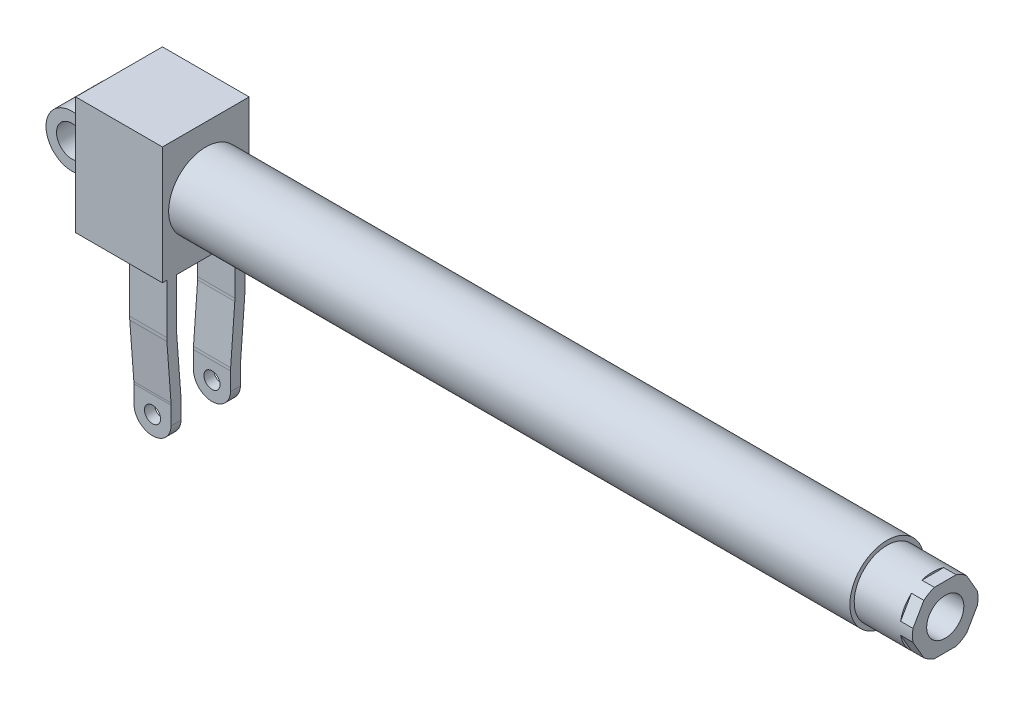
ISO-10303-21;
HEADER;
FILE_DESCRIPTION(('STEP AP214'),'2;1');
FILE_NAME('part.step','',(''),(''),'','','');
FILE_SCHEMA(('AUTOMOTIVE_DESIGN { 1 0 10303 214 1 1 1 1 }'));
ENDSEC;
DATA;
#1=APPLICATION_CONTEXT('core data for automotive mechanical design processes');
#2=APPLICATION_PROTOCOL_DEFINITION('international standard','automotive_design',2000,#1);
#3=PRODUCT_CONTEXT('',#1,'mechanical');
#4=PRODUCT('Part','Part','',(#3));
#5=PRODUCT_RELATED_PRODUCT_CATEGORY('part','',(#4));
#6=PRODUCT_DEFINITION_FORMATION('','',#4);
#7=PRODUCT_DEFINITION_CONTEXT('part definition',#1,'design');
#8=PRODUCT_DEFINITION('design','',#6,#7);
#9=PRODUCT_DEFINITION_SHAPE('','',#8);
#10=(LENGTH_UNIT() NAMED_UNIT(*) SI_UNIT(.MILLI.,.METRE.));
#11=(NAMED_UNIT(*) PLANE_ANGLE_UNIT() SI_UNIT($,.RADIAN.));
#12=(NAMED_UNIT(*) SI_UNIT($,.STERADIAN.) SOLID_ANGLE_UNIT());
#13=UNCERTAINTY_MEASURE_WITH_UNIT(LENGTH_MEASURE(1.E-05),#10,'distance_accuracy_value','');
#14=(GEOMETRIC_REPRESENTATION_CONTEXT(3) GLOBAL_UNCERTAINTY_ASSIGNED_CONTEXT((#13)) GLOBAL_UNIT_ASSIGNED_CONTEXT((#10,
#11,#12)) REPRESENTATION_CONTEXT('',''));
#15=CARTESIAN_POINT('',(0.,0.,0.));
#16=DIRECTION('',(0.,0.,1.));
#17=DIRECTION('',(1.,0.,0.));
#18=AXIS2_PLACEMENT_3D('',#15,#16,#17);
#19=CARTESIAN_POINT('',(88.,0.,0.));
#20=DIRECTION('',(1.,0.,0.));
#21=DIRECTION('',(0.,0.,-1.));
#22=AXIS2_PLACEMENT_3D('',#19,#20,#21);
#23=PLANE('',#22);
#24=CARTESIAN_POINT('',(88.,0.,0.));
#25=DIRECTION('',(-1.,0.,0.));
#26=DIRECTION('',(0.,0.,1.));
#27=AXIS2_PLACEMENT_3D('',#24,#25,#26);
#28=CIRCLE('',#27,20.);
#29=CARTESIAN_POINT('',(88.,0.,20.));
#30=VERTEX_POINT('',#29);
#31=EDGE_CURVE('E19',#30,#30,#28,.F.);
#32=ORIENTED_EDGE('',*,*,#31,.T.);
#33=EDGE_LOOP('',(#32));
#34=FACE_BOUND('',#33,.T.);
#35=ADVANCED_FACE('F15',(#34),#23,.T.);
#36=CARTESIAN_POINT('',(588.,0.,0.));
#37=DIRECTION('',(-1.,0.,0.));
#38=DIRECTION('',(0.,0.,1.));
#39=AXIS2_PLACEMENT_3D('',#36,#37,#38);
#40=CYLINDRICAL_SURFACE('',#39,20.);
#41=ORIENTED_EDGE('',*,*,#31,.F.);
#42=EDGE_LOOP('',(#41));
#43=FACE_BOUND('',#42,.T.);
#44=CARTESIAN_POINT('',(588.,0.,0.));
#45=DIRECTION('',(-1.,0.,0.));
#46=DIRECTION('',(0.,0.,1.));
#47=AXIS2_PLACEMENT_3D('',#44,#45,#46);
#48=CIRCLE('',#47,20.);
#49=CARTESIAN_POINT('',(588.,0.,20.));
#50=VERTEX_POINT('',#49);
#51=EDGE_CURVE('E396',#50,#50,#48,.F.);
#52=ORIENTED_EDGE('',*,*,#51,.T.);
#53=EDGE_LOOP('',(#52));
#54=FACE_BOUND('',#53,.T.);
#55=ADVANCED_FACE('F404',(#43,#54),#40,.F.);
#56=CARTESIAN_POINT('',(588.,0.,0.));
#57=DIRECTION('',(1.,0.,0.));
#58=DIRECTION('',(0.,0.,-1.));
#59=AXIS2_PLACEMENT_3D('',#56,#57,#58);
#60=PLANE('',#59);
#61=ORIENTED_EDGE('',*,*,#51,.F.);
#62=EDGE_LOOP('',(#61));
#63=FACE_BOUND('',#62,.T.);
#64=CARTESIAN_POINT('',(588.,0.,0.));
#65=DIRECTION('',(-1.,0.,0.));
#66=DIRECTION('',(0.,0.,1.));
#67=AXIS2_PLACEMENT_3D('',#64,#65,#66);
#68=CIRCLE('',#67,15.);
#69=CARTESIAN_POINT('',(588.,0.,15.));
#70=VERTEX_POINT('',#69);
#71=EDGE_CURVE('E394',#70,#70,#68,.F.);
#72=ORIENTED_EDGE('',*,*,#71,.T.);
#73=EDGE_LOOP('',(#72));
#74=FACE_BOUND('',#73,.T.);
#75=ADVANCED_FACE('F406',(#63,#74),#60,.F.);
#76=CARTESIAN_POINT('',(0.,0.,20.));
#77=DIRECTION('',(0.,0.,-1.));
#78=DIRECTION('',(-1.,0.,0.));
#79=AXIS2_PLACEMENT_3D('',#76,#77,#78);
#80=CYLINDRICAL_SURFACE('',#79,12.5);
#81=CARTESIAN_POINT('',(0.,0.,20.));
#82=DIRECTION('',(0.,0.,-1.));
#83=DIRECTION('',(-1.,0.,0.));
#84=AXIS2_PLACEMENT_3D('',#81,#82,#83);
#85=CIRCLE('',#84,12.5);
#86=CARTESIAN_POINT('',(-12.5,0.,20.));
#87=VERTEX_POINT('',#86);
#88=EDGE_CURVE('E215',#87,#87,#85,.T.);
#89=ORIENTED_EDGE('',*,*,#88,.F.);
#90=EDGE_LOOP('',(#89));
#91=FACE_BOUND('',#90,.T.);
#92=CARTESIAN_POINT('',(0.,0.,-20.));
#93=DIRECTION('',(0.,0.,-1.));
#94=DIRECTION('',(-1.,0.,0.));
#95=AXIS2_PLACEMENT_3D('',#92,#93,#94);
#96=CIRCLE('',#95,12.5);
#97=CARTESIAN_POINT('',(-12.5,0.,-20.));
#98=VERTEX_POINT('',#97);
#99=EDGE_CURVE('E216',#98,#98,#96,.T.);
#100=ORIENTED_EDGE('',*,*,#99,.T.);
#101=EDGE_LOOP('',(#100));
#102=FACE_BOUND('',#101,.T.);
#103=ADVANCED_FACE('F413',(#91,#102),#80,.F.);
#104=CARTESIAN_POINT('',(685.,0.,0.));
#105=DIRECTION('',(-1.,0.,0.));
#106=DIRECTION('',(0.,0.,1.));
#107=AXIS2_PLACEMENT_3D('',#104,#105,#106);
#108=CYLINDRICAL_SURFACE('',#107,15.);
#109=CARTESIAN_POINT('',(685.,0.,0.));
#110=DIRECTION('',(-1.,0.,0.));
#111=DIRECTION('',(0.,0.,1.));
#112=AXIS2_PLACEMENT_3D('',#109,#110,#111);
#113=CIRCLE('',#112,15.);
#114=CARTESIAN_POINT('',(685.,0.,15.));
#115=VERTEX_POINT('',#114);
#116=EDGE_CURVE('E383',#115,#115,#113,.T.);
#117=ORIENTED_EDGE('',*,*,#116,.F.);
#118=EDGE_LOOP('',(#117));
#119=FACE_BOUND('',#118,.T.);
#120=ORIENTED_EDGE('',*,*,#71,.F.);
#121=EDGE_LOOP('',(#120));
#122=FACE_BOUND('',#121,.T.);
#123=ADVANCED_FACE('F655',(#119,#122),#108,.F.);
#124=CARTESIAN_POINT('',(0.,0.,-20.));
#125=DIRECTION('',(0.,0.,1.));
#126=DIRECTION('',(1.,0.,0.));
#127=AXIS2_PLACEMENT_3D('',#124,#125,#126);
#128=PLANE('',#127);
#129=CARTESIAN_POINT('',(0.,0.,-20.));
#130=DIRECTION('',(0.,0.,-1.));
#131=DIRECTION('',(-1.,0.,0.));
#132=AXIS2_PLACEMENT_3D('',#129,#130,#131);
#133=CIRCLE('',#132,21.);
#134=CARTESIAN_POINT('',(18.,10.816653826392,-20.));
#135=VERTEX_POINT('',#134);
#136=CARTESIAN_POINT('',(18.,-10.816653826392,-20.));
#137=VERTEX_POINT('',#136);
#138=EDGE_CURVE('E209',#135,#137,#133,.F.);
#139=ORIENTED_EDGE('',*,*,#138,.F.);
#140=DIRECTION('',(0.,1.,0.));
#141=VECTOR('',#140,1.);
#142=CARTESIAN_POINT('',(18.,47.5,-20.));
#143=LINE('',#142,#141);
#144=EDGE_CURVE('E207',#135,#137,#143,.F.);
#145=ORIENTED_EDGE('',*,*,#144,.T.);
#146=EDGE_LOOP('',(#139,#145));
#147=FACE_BOUND('',#146,.T.);
#148=ORIENTED_EDGE('',*,*,#99,.F.);
#149=EDGE_LOOP('',(#148));
#150=FACE_BOUND('',#149,.T.);
#151=ADVANCED_FACE('F211',(#147,#150),#128,.F.);
#152=CARTESIAN_POINT('',(0.,0.,20.));
#153=DIRECTION('',(0.,0.,-1.));
#154=DIRECTION('',(-1.,0.,0.));
#155=AXIS2_PLACEMENT_3D('',#152,#153,#154);
#156=CYLINDRICAL_SURFACE('',#155,21.);
#157=ORIENTED_EDGE('',*,*,#138,.T.);
#158=DIRECTION('',(0.,0.,1.));
#159=VECTOR('',#158,1.);
#160=CARTESIAN_POINT('',(18.,-10.816653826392,35.));
#161=LINE('',#160,#159);
#162=CARTESIAN_POINT('',(18.,-10.816653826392,20.));
#163=VERTEX_POINT('',#162);
#164=EDGE_CURVE('E230',#137,#163,#161,.T.);
#165=ORIENTED_EDGE('',*,*,#164,.T.);
#166=CARTESIAN_POINT('',(0.,0.,20.));
#167=DIRECTION('',(0.,0.,-1.));
#168=DIRECTION('',(-1.,0.,0.));
#169=AXIS2_PLACEMENT_3D('',#166,#167,#168);
#170=CIRCLE('',#169,21.);
#171=CARTESIAN_POINT('',(18.,10.816653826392,20.));
#172=VERTEX_POINT('',#171);
#173=EDGE_CURVE('E222',#172,#163,#170,.F.);
#174=ORIENTED_EDGE('',*,*,#173,.F.);
#175=DIRECTION('',(0.,0.,1.));
#176=VECTOR('',#175,1.);
#177=CARTESIAN_POINT('',(18.,10.816653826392,35.));
#178=LINE('',#177,#176);
#179=EDGE_CURVE('E219',#172,#135,#178,.F.);
#180=ORIENTED_EDGE('',*,*,#179,.T.);
#181=EDGE_LOOP('',(#157,#165,#174,#180));
#182=FACE_BOUND('',#181,.T.);
#183=ADVANCED_FACE('F220',(#182),#156,.T.);
#184=CARTESIAN_POINT('',(0.,0.,20.));
#185=DIRECTION('',(0.,0.,1.));
#186=DIRECTION('',(1.,0.,0.));
#187=AXIS2_PLACEMENT_3D('',#184,#185,#186);
#188=PLANE('',#187);
#189=ORIENTED_EDGE('',*,*,#173,.T.);
#190=DIRECTION('',(0.,1.,0.));
#191=VECTOR('',#190,1.);
#192=CARTESIAN_POINT('',(18.,47.5,20.));
#193=LINE('',#192,#191);
#194=EDGE_CURVE('E232',#163,#172,#193,.T.);
#195=ORIENTED_EDGE('',*,*,#194,.T.);
#196=EDGE_LOOP('',(#189,#195));
#197=FACE_BOUND('',#196,.T.);
#198=ORIENTED_EDGE('',*,*,#88,.T.);
#199=EDGE_LOOP('',(#198));
#200=FACE_BOUND('',#199,.T.);
#201=ADVANCED_FACE('F646',(#197,#200),#188,.T.);
#202=CARTESIAN_POINT('',(675.,1.50318354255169E-13,0.));
#203=DIRECTION('',(1.,0.,0.));
#204=DIRECTION('',(0.,1.,0.));
#205=AXIS2_PLACEMENT_3D('',#202,#203,#204);
#206=PLANE('',#205);
#207=CARTESIAN_POINT('',(675.,2.57652086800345E-13,0.));
#208=DIRECTION('',(-1.,0.,0.));
#209=DIRECTION('',(0.,-1.,0.));
#210=AXIS2_PLACEMENT_3D('',#207,#208,#209);
#211=CIRCLE('',#210,26.5);
#212=CARTESIAN_POINT('',(675.,20.1116686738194,-17.2560361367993));
#213=VERTEX_POINT('',#212);
#214=CARTESIAN_POINT('',(675.,4.8883313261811,-26.0452340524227));
#215=VERTEX_POINT('',#214);
#216=EDGE_CURVE('E367',#213,#215,#211,.T.);
#217=ORIENTED_EDGE('',*,*,#216,.F.);
#218=DIRECTION('',(0.,0.866025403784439,0.5));
#219=VECTOR('',#218,1.);
#220=CARTESIAN_POINT('',(675.,2.95816003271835E-13,-28.8675134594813));
#221=LINE('',#220,#219);
#222=EDGE_CURVE('E389',#215,#213,#221,.T.);
#223=ORIENTED_EDGE('',*,*,#222,.F.);
#224=EDGE_LOOP('',(#217,#223));
#225=FACE_BOUND('',#224,.T.);
#226=ADVANCED_FACE('F649',(#225),#206,.T.);
#227=CARTESIAN_POINT('',(675.,2.95816003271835E-13,-28.8675134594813));
#228=DIRECTION('',(0.,0.5,-0.866025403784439));
#229=DIRECTION('',(0.,0.866025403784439,0.5));
#230=AXIS2_PLACEMENT_3D('',#227,#228,#229);
#231=PLANE('',#230);
#232=DIRECTION('',(-1.,0.,0.));
#233=VECTOR('',#232,1.);
#234=CARTESIAN_POINT('',(685.,20.1116686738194,-17.2560361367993));
#235=LINE('',#234,#233);
#236=CARTESIAN_POINT('',(685.,20.1116686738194,-17.2560361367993));
#237=VERTEX_POINT('',#236);
#238=EDGE_CURVE('E370',#237,#213,#235,.T.);
#239=ORIENTED_EDGE('',*,*,#238,.F.);
#240=DIRECTION('',(0.,0.866025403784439,0.499999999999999));
#241=VECTOR('',#240,1.);
#242=CARTESIAN_POINT('',(685.,4.8883313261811,-26.0452340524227));
#243=LINE('',#242,#241);
#244=CARTESIAN_POINT('',(685.,4.88833132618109,-26.0452340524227));
#245=VERTEX_POINT('',#244);
#246=EDGE_CURVE('E387',#245,#237,#243,.T.);
#247=ORIENTED_EDGE('',*,*,#246,.F.);
#248=DIRECTION('',(-1.,0.,0.));
#249=VECTOR('',#248,1.);
#250=CARTESIAN_POINT('',(685.,4.8883313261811,-26.0452340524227));
#251=LINE('',#250,#249);
#252=EDGE_CURVE('E366',#215,#245,#251,.F.);
#253=ORIENTED_EDGE('',*,*,#252,.F.);
#254=ORIENTED_EDGE('',*,*,#222,.T.);
#255=EDGE_LOOP('',(#239,#247,#253,#254));
#256=FACE_BOUND('',#255,.T.);
#257=ADVANCED_FACE('F670',(#256),#231,.T.);
#258=CARTESIAN_POINT('',(675.,1.50318354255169E-13,0.));
#259=DIRECTION('',(1.,0.,0.));
#260=DIRECTION('',(0.,1.,0.));
#261=AXIS2_PLACEMENT_3D('',#258,#259,#260);
#262=PLANE('',#261);
#263=CARTESIAN_POINT('',(675.,2.57652086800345E-13,0.));
#264=DIRECTION('',(-1.,0.,0.));
#265=DIRECTION('',(0.,-1.,0.));
#266=AXIS2_PLACEMENT_3D('',#263,#264,#265);
#267=CIRCLE('',#266,26.5);
#268=CARTESIAN_POINT('',(675.,-4.88833132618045,-26.0452340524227));
#269=VERTEX_POINT('',#268);
#270=CARTESIAN_POINT('',(675.,-20.111668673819,-17.2560361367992));
#271=VERTEX_POINT('',#270);
#272=EDGE_CURVE('E359',#269,#271,#267,.T.);
#273=ORIENTED_EDGE('',*,*,#272,.F.);
#274=DIRECTION('',(0.,0.866025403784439,-0.5));
#275=VECTOR('',#274,1.);
#276=CARTESIAN_POINT('',(675.,-24.9999999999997,-14.4337567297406));
#277=LINE('',#276,#275);
#278=EDGE_CURVE('E629',#271,#269,#277,.T.);
#279=ORIENTED_EDGE('',*,*,#278,.F.);
#280=EDGE_LOOP('',(#273,#279));
#281=FACE_BOUND('',#280,.T.);
#282=ADVANCED_FACE('F674',(#281),#262,.T.);
#283=CARTESIAN_POINT('',(675.,-24.9999999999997,-14.4337567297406));
#284=DIRECTION('',(0.,-0.5,-0.866025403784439));
#285=DIRECTION('',(0.,0.866025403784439,-0.5));
#286=AXIS2_PLACEMENT_3D('',#283,#284,#285);
#287=PLANE('',#286);
#288=DIRECTION('',(-1.,0.,0.));
#289=VECTOR('',#288,1.);
#290=CARTESIAN_POINT('',(685.,-4.88833132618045,-26.0452340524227));
#291=LINE('',#290,#289);
#292=CARTESIAN_POINT('',(685.,-4.88833132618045,-26.0452340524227));
#293=VERTEX_POINT('',#292);
#294=EDGE_CURVE('E362',#293,#269,#291,.T.);
#295=ORIENTED_EDGE('',*,*,#294,.F.);
#296=DIRECTION('',(0.,0.866025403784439,-0.5));
#297=VECTOR('',#296,1.);
#298=CARTESIAN_POINT('',(685.,-20.111668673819,-17.2560361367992));
#299=LINE('',#298,#297);
#300=CARTESIAN_POINT('',(685.,-20.111668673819,-17.2560361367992));
#301=VERTEX_POINT('',#300);
#302=EDGE_CURVE('E866',#301,#293,#299,.T.);
#303=ORIENTED_EDGE('',*,*,#302,.F.);
#304=DIRECTION('',(-1.,0.,0.));
#305=VECTOR('',#304,1.);
#306=CARTESIAN_POINT('',(685.,-20.111668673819,-17.2560361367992));
#307=LINE('',#306,#305);
#308=EDGE_CURVE('E358',#271,#301,#307,.F.);
#309=ORIENTED_EDGE('',*,*,#308,.F.);
#310=ORIENTED_EDGE('',*,*,#278,.T.);
#311=EDGE_LOOP('',(#295,#303,#309,#310));
#312=FACE_BOUND('',#311,.T.);
#313=ADVANCED_FACE('F678',(#312),#287,.T.);
#314=CARTESIAN_POINT('',(675.,1.50318354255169E-13,0.));
#315=DIRECTION('',(1.,0.,0.));
#316=DIRECTION('',(0.,1.,0.));
#317=AXIS2_PLACEMENT_3D('',#314,#315,#316);
#318=PLANE('',#317);
#319=CARTESIAN_POINT('',(675.,2.57652086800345E-13,0.));
#320=DIRECTION('',(-1.,0.,0.));
#321=DIRECTION('',(0.,-1.,0.));
#322=AXIS2_PLACEMENT_3D('',#319,#320,#321);
#323=CIRCLE('',#322,26.5);
#324=CARTESIAN_POINT('',(675.,25.0000000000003,8.78919791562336));
#325=VERTEX_POINT('',#324);
#326=CARTESIAN_POINT('',(675.,25.0000000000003,-8.78919791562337));
#327=VERTEX_POINT('',#326);
#328=EDGE_CURVE('E352',#325,#327,#323,.T.);
#329=ORIENTED_EDGE('',*,*,#328,.F.);
#330=DIRECTION('',(0.,0.,1.));
#331=VECTOR('',#330,1.);
#332=CARTESIAN_POINT('',(675.,25.0000000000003,-14.4337567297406));
#333=LINE('',#332,#331);
#334=EDGE_CURVE('E386',#327,#325,#333,.T.);
#335=ORIENTED_EDGE('',*,*,#334,.F.);
#336=EDGE_LOOP('',(#329,#335));
#337=FACE_BOUND('',#336,.T.);
#338=ADVANCED_FACE('F682',(#337),#318,.T.);
#339=CARTESIAN_POINT('',(675.,1.50318354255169E-13,0.));
#340=DIRECTION('',(1.,0.,0.));
#341=DIRECTION('',(0.,1.,0.));
#342=AXIS2_PLACEMENT_3D('',#339,#340,#341);
#343=PLANE('',#342);
#344=CARTESIAN_POINT('',(675.,2.57652086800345E-13,0.));
#345=DIRECTION('',(-1.,0.,0.));
#346=DIRECTION('',(0.,-1.,0.));
#347=AXIS2_PLACEMENT_3D('',#344,#345,#346);
#348=CIRCLE('',#347,26.5);
#349=CARTESIAN_POINT('',(675.,-24.9999999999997,-8.78919791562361));
#350=VERTEX_POINT('',#349);
#351=CARTESIAN_POINT('',(675.,-24.9999999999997,8.78919791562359));
#352=VERTEX_POINT('',#351);
#353=EDGE_CURVE('E349',#350,#352,#348,.T.);
#354=ORIENTED_EDGE('',*,*,#353,.F.);
#355=DIRECTION('',(0.,0.,1.));
#356=VECTOR('',#355,1.);
#357=CARTESIAN_POINT('',(675.,-24.9999999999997,14.4337567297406));
#358=LINE('',#357,#356);
#359=EDGE_CURVE('E622',#352,#350,#358,.F.);
#360=ORIENTED_EDGE('',*,*,#359,.F.);
#361=EDGE_LOOP('',(#354,#360));
#362=FACE_BOUND('',#361,.T.);
#363=ADVANCED_FACE('F686',(#362),#343,.T.);
#364=CARTESIAN_POINT('',(675.,-24.9999999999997,14.4337567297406));
#365=DIRECTION('',(0.,-1.,0.));
#366=DIRECTION('',(1.,0.,0.));
#367=AXIS2_PLACEMENT_3D('',#364,#365,#366);
#368=PLANE('',#367);
#369=DIRECTION('',(-1.,0.,0.));
#370=VECTOR('',#369,1.);
#371=CARTESIAN_POINT('',(685.,-24.9999999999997,-8.78919791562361));
#372=LINE('',#371,#370);
#373=CARTESIAN_POINT('',(685.,-24.9999999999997,-8.7891979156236));
#374=VERTEX_POINT('',#373);
#375=EDGE_CURVE('E354',#374,#350,#372,.T.);
#376=ORIENTED_EDGE('',*,*,#375,.F.);
#377=DIRECTION('',(0.,0.,1.));
#378=VECTOR('',#377,1.);
#379=CARTESIAN_POINT('',(685.,-24.9999999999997,0.));
#380=LINE('',#379,#378);
#381=CARTESIAN_POINT('',(685.,-24.9999999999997,8.78919791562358));
#382=VERTEX_POINT('',#381);
#383=EDGE_CURVE('E868',#382,#374,#380,.F.);
#384=ORIENTED_EDGE('',*,*,#383,.F.);
#385=DIRECTION('',(-1.,0.,0.));
#386=VECTOR('',#385,1.);
#387=CARTESIAN_POINT('',(685.,-24.9999999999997,8.78919791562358));
#388=LINE('',#387,#386);
#389=EDGE_CURVE('E348',#352,#382,#388,.F.);
#390=ORIENTED_EDGE('',*,*,#389,.F.);
#391=ORIENTED_EDGE('',*,*,#359,.T.);
#392=EDGE_LOOP('',(#376,#384,#390,#391));
#393=FACE_BOUND('',#392,.T.);
#394=ADVANCED_FACE('F690',(#393),#368,.T.);
#395=CARTESIAN_POINT('',(675.,1.50318354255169E-13,0.));
#396=DIRECTION('',(1.,0.,0.));
#397=DIRECTION('',(0.,1.,0.));
#398=AXIS2_PLACEMENT_3D('',#395,#396,#397);
#399=PLANE('',#398);
#400=CARTESIAN_POINT('',(675.,2.57652086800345E-13,0.));
#401=DIRECTION('',(-1.,0.,0.));
#402=DIRECTION('',(0.,-1.,0.));
#403=AXIS2_PLACEMENT_3D('',#400,#401,#402);
#404=CIRCLE('',#403,26.5);
#405=CARTESIAN_POINT('',(675.,-20.111668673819,17.2560361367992));
#406=VERTEX_POINT('',#405);
#407=CARTESIAN_POINT('',(675.,-4.88833132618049,26.0452340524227));
#408=VERTEX_POINT('',#407);
#409=EDGE_CURVE('E341',#406,#408,#404,.T.);
#410=ORIENTED_EDGE('',*,*,#409,.F.);
#411=DIRECTION('',(0.,-0.866025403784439,-0.5));
#412=VECTOR('',#411,1.);
#413=CARTESIAN_POINT('',(675.,2.95816003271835E-13,28.8675134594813));
#414=LINE('',#413,#412);
#415=EDGE_CURVE('E616',#408,#406,#414,.T.);
#416=ORIENTED_EDGE('',*,*,#415,.F.);
#417=EDGE_LOOP('',(#410,#416));
#418=FACE_BOUND('',#417,.T.);
#419=ADVANCED_FACE('F694',(#418),#399,.T.);
#420=CARTESIAN_POINT('',(675.,2.95816003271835E-13,28.8675134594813));
#421=DIRECTION('',(0.,-0.5,0.866025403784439));
#422=DIRECTION('',(0.,-0.866025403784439,-0.5));
#423=AXIS2_PLACEMENT_3D('',#420,#421,#422);
#424=PLANE('',#423);
#425=DIRECTION('',(-1.,0.,0.));
#426=VECTOR('',#425,1.);
#427=CARTESIAN_POINT('',(685.,-20.111668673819,17.2560361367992));
#428=LINE('',#427,#426);
#429=CARTESIAN_POINT('',(685.,-20.111668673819,17.2560361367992));
#430=VERTEX_POINT('',#429);
#431=EDGE_CURVE('E344',#430,#406,#428,.T.);
#432=ORIENTED_EDGE('',*,*,#431,.F.);
#433=DIRECTION('',(0.,-0.866025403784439,-0.5));
#434=VECTOR('',#433,1.);
#435=CARTESIAN_POINT('',(685.,-4.88833132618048,26.0452340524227));
#436=LINE('',#435,#434);
#437=CARTESIAN_POINT('',(685.,-4.88833132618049,26.0452340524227));
#438=VERTEX_POINT('',#437);
#439=EDGE_CURVE('E875',#438,#430,#436,.T.);
#440=ORIENTED_EDGE('',*,*,#439,.F.);
#441=DIRECTION('',(-1.,0.,0.));
#442=VECTOR('',#441,1.);
#443=CARTESIAN_POINT('',(685.,-4.88833132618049,26.0452340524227));
#444=LINE('',#443,#442);
#445=EDGE_CURVE('E340',#408,#438,#444,.F.);
#446=ORIENTED_EDGE('',*,*,#445,.F.);
#447=ORIENTED_EDGE('',*,*,#415,.T.);
#448=EDGE_LOOP('',(#432,#440,#446,#447));
#449=FACE_BOUND('',#448,.T.);
#450=ADVANCED_FACE('F698',(#449),#424,.T.);
#451=CARTESIAN_POINT('',(675.,1.50318354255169E-13,0.));
#452=DIRECTION('',(1.,0.,0.));
#453=DIRECTION('',(0.,1.,0.));
#454=AXIS2_PLACEMENT_3D('',#451,#452,#453);
#455=PLANE('',#454);
#456=CARTESIAN_POINT('',(675.,2.57652086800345E-13,0.));
#457=DIRECTION('',(-1.,0.,0.));
#458=DIRECTION('',(0.,-1.,0.));
#459=AXIS2_PLACEMENT_3D('',#456,#457,#458);
#460=CIRCLE('',#459,26.5);
#461=CARTESIAN_POINT('',(675.,4.88833132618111,26.0452340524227));
#462=VERTEX_POINT('',#461);
#463=CARTESIAN_POINT('',(675.,20.1116686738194,17.2560361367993));
#464=VERTEX_POINT('',#463);
#465=EDGE_CURVE('E333',#462,#464,#460,.T.);
#466=ORIENTED_EDGE('',*,*,#465,.F.);
#467=DIRECTION('',(0.,-0.866025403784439,0.5));
#468=VECTOR('',#467,1.);
#469=CARTESIAN_POINT('',(675.,25.0000000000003,14.4337567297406));
#470=LINE('',#469,#468);
#471=EDGE_CURVE('E613',#464,#462,#470,.T.);
#472=ORIENTED_EDGE('',*,*,#471,.F.);
#473=EDGE_LOOP('',(#466,#472));
#474=FACE_BOUND('',#473,.T.);
#475=ADVANCED_FACE('F702',(#474),#455,.T.);
#476=CARTESIAN_POINT('',(675.,25.0000000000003,14.4337567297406));
#477=DIRECTION('',(0.,0.5,0.866025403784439));
#478=DIRECTION('',(0.,-0.866025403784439,0.5));
#479=AXIS2_PLACEMENT_3D('',#476,#477,#478);
#480=PLANE('',#479);
#481=DIRECTION('',(-1.,0.,0.));
#482=VECTOR('',#481,1.);
#483=CARTESIAN_POINT('',(685.,4.88833132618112,26.0452340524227));
#484=LINE('',#483,#482);
#485=CARTESIAN_POINT('',(685.,4.88833132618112,26.0452340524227));
#486=VERTEX_POINT('',#485);
#487=EDGE_CURVE('E336',#486,#462,#484,.T.);
#488=ORIENTED_EDGE('',*,*,#487,.F.);
#489=DIRECTION('',(0.,-0.866025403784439,0.5));
#490=VECTOR('',#489,1.);
#491=CARTESIAN_POINT('',(685.,20.1116686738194,17.2560361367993));
#492=LINE('',#491,#490);
#493=CARTESIAN_POINT('',(685.,20.1116686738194,17.2560361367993));
#494=VERTEX_POINT('',#493);
#495=EDGE_CURVE('E615',#494,#486,#492,.T.);
#496=ORIENTED_EDGE('',*,*,#495,.F.);
#497=DIRECTION('',(-1.,0.,0.));
#498=VECTOR('',#497,1.);
#499=CARTESIAN_POINT('',(685.,20.1116686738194,17.2560361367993));
#500=LINE('',#499,#498);
#501=EDGE_CURVE('E332',#464,#494,#500,.F.);
#502=ORIENTED_EDGE('',*,*,#501,.F.);
#503=ORIENTED_EDGE('',*,*,#471,.T.);
#504=EDGE_LOOP('',(#488,#496,#502,#503));
#505=FACE_BOUND('',#504,.T.);
#506=ADVANCED_FACE('F706',(#505),#480,.T.);
#507=CARTESIAN_POINT('',(685.,2.62034546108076E-13,0.));
#508=DIRECTION('',(1.,0.,0.));
#509=DIRECTION('',(0.,1.,0.));
#510=AXIS2_PLACEMENT_3D('',#507,#508,#509);
#511=PLANE('',#510);
#512=ORIENTED_EDGE('',*,*,#116,.T.);
#513=EDGE_LOOP('',(#512));
#514=FACE_BOUND('',#513,.T.);
#515=CARTESIAN_POINT('',(685.,2.62034546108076E-13,0.));
#516=DIRECTION('',(-1.,0.,0.));
#517=DIRECTION('',(0.,-1.,0.));
#518=AXIS2_PLACEMENT_3D('',#515,#516,#517);
#519=CIRCLE('',#518,26.5);
#520=CARTESIAN_POINT('',(685.,25.0000000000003,-8.78919791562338));
#521=VERTEX_POINT('',#520);
#522=EDGE_CURVE('E371',#521,#237,#519,.T.);
#523=ORIENTED_EDGE('',*,*,#522,.F.);
#524=DIRECTION('',(0.,0.,1.));
#525=VECTOR('',#524,1.);
#526=CARTESIAN_POINT('',(685.,25.0000000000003,-14.4337567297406));
#527=LINE('',#526,#525);
#528=CARTESIAN_POINT('',(685.,25.0000000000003,8.78919791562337));
#529=VERTEX_POINT('',#528);
#530=EDGE_CURVE('E382',#529,#521,#527,.F.);
#531=ORIENTED_EDGE('',*,*,#530,.F.);
#532=CARTESIAN_POINT('',(685.,2.62034546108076E-13,0.));
#533=DIRECTION('',(-1.,0.,0.));
#534=DIRECTION('',(0.,-1.,0.));
#535=AXIS2_PLACEMENT_3D('',#532,#533,#534);
#536=CIRCLE('',#535,26.5);
#537=EDGE_CURVE('E328',#494,#529,#536,.T.);
#538=ORIENTED_EDGE('',*,*,#537,.F.);
#539=ORIENTED_EDGE('',*,*,#495,.T.);
#540=CARTESIAN_POINT('',(685.,2.62034546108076E-13,0.));
#541=DIRECTION('',(-1.,0.,0.));
#542=DIRECTION('',(0.,-1.,0.));
#543=AXIS2_PLACEMENT_3D('',#540,#541,#542);
#544=CIRCLE('',#543,26.5);
#545=EDGE_CURVE('E337',#438,#486,#544,.T.);
#546=ORIENTED_EDGE('',*,*,#545,.F.);
#547=ORIENTED_EDGE('',*,*,#439,.T.);
#548=CARTESIAN_POINT('',(685.,2.62034546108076E-13,0.));
#549=DIRECTION('',(-1.,0.,0.));
#550=DIRECTION('',(0.,-1.,0.));
#551=AXIS2_PLACEMENT_3D('',#548,#549,#550);
#552=CIRCLE('',#551,26.5);
#553=EDGE_CURVE('E345',#382,#430,#552,.T.);
#554=ORIENTED_EDGE('',*,*,#553,.F.);
#555=ORIENTED_EDGE('',*,*,#383,.T.);
#556=CARTESIAN_POINT('',(685.,2.62034546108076E-13,0.));
#557=DIRECTION('',(-1.,0.,0.));
#558=DIRECTION('',(0.,-1.,0.));
#559=AXIS2_PLACEMENT_3D('',#556,#557,#558);
#560=CIRCLE('',#559,26.5);
#561=EDGE_CURVE('E355',#301,#374,#560,.T.);
#562=ORIENTED_EDGE('',*,*,#561,.F.);
#563=ORIENTED_EDGE('',*,*,#302,.T.);
#564=CARTESIAN_POINT('',(685.,2.62034546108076E-13,0.));
#565=DIRECTION('',(-1.,0.,0.));
#566=DIRECTION('',(0.,-1.,0.));
#567=AXIS2_PLACEMENT_3D('',#564,#565,#566);
#568=CIRCLE('',#567,26.5);
#569=EDGE_CURVE('E363',#245,#293,#568,.T.);
#570=ORIENTED_EDGE('',*,*,#569,.F.);
#571=ORIENTED_EDGE('',*,*,#246,.T.);
#572=EDGE_LOOP('',(#523,#531,#538,#539,#546,#547,#554,#555,#562,#563,#570,#571));
#573=FACE_BOUND('',#572,.T.);
#574=ADVANCED_FACE('F710',(#514,#573),#511,.T.);
#575=CARTESIAN_POINT('',(675.,25.0000000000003,-14.4337567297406));
#576=DIRECTION('',(0.,1.,0.));
#577=DIRECTION('',(-1.,0.,0.));
#578=AXIS2_PLACEMENT_3D('',#575,#576,#577);
#579=PLANE('',#578);
#580=DIRECTION('',(-1.,0.,0.));
#581=VECTOR('',#580,1.);
#582=CARTESIAN_POINT('',(685.,25.0000000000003,8.78919791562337));
#583=LINE('',#582,#581);
#584=EDGE_CURVE('E331',#529,#325,#583,.T.);
#585=ORIENTED_EDGE('',*,*,#584,.F.);
#586=ORIENTED_EDGE('',*,*,#530,.T.);
#587=DIRECTION('',(-1.,0.,0.));
#588=VECTOR('',#587,1.);
#589=CARTESIAN_POINT('',(685.,25.0000000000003,-8.78919791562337));
#590=LINE('',#589,#588);
#591=EDGE_CURVE('E374',#327,#521,#590,.F.);
#592=ORIENTED_EDGE('',*,*,#591,.F.);
#593=ORIENTED_EDGE('',*,*,#334,.T.);
#594=EDGE_LOOP('',(#585,#586,#592,#593));
#595=FACE_BOUND('',#594,.T.);
#596=ADVANCED_FACE('F714',(#595),#579,.T.);
#597=CARTESIAN_POINT('',(58.0000000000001,-136.618283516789,-50.));
#598=DIRECTION('',(1.,0.,0.));
#599=DIRECTION('',(0.,1.,0.));
#600=AXIS2_PLACEMENT_3D('',#597,#598,#599);
#601=CYLINDRICAL_SURFACE('',#600,22.);
#602=DIRECTION('',(1.,0.,0.));
#603=VECTOR('',#602,1.);
#604=CARTESIAN_POINT('',(58.0000000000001,-136.618283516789,-28.));
#605=LINE('',#604,#603);
#606=CARTESIAN_POINT('',(88.,-136.618283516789,-28.));
#607=VERTEX_POINT('',#606);
#608=CARTESIAN_POINT('',(58.0000000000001,-136.618283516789,-28.));
#609=VERTEX_POINT('',#608);
#610=EDGE_CURVE('E316',#607,#609,#605,.F.);
#611=ORIENTED_EDGE('',*,*,#610,.T.);
#612=CARTESIAN_POINT('',(58.0000000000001,-136.618283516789,-50.));
#613=DIRECTION('',(1.,0.,0.));
#614=DIRECTION('',(0.,1.,0.));
#615=AXIS2_PLACEMENT_3D('',#612,#613,#614);
#616=CIRCLE('',#615,22.);
#617=CARTESIAN_POINT('',(58.0000000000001,-134.98041019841,-28.0610535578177));
#618=VERTEX_POINT('',#617);
#619=EDGE_CURVE('E379',#609,#618,#616,.F.);
#620=ORIENTED_EDGE('',*,*,#619,.T.);
#621=DIRECTION('',(1.,0.,0.));
#622=VECTOR('',#621,1.);
#623=CARTESIAN_POINT('',(58.,-134.98041019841,-28.0610535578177));
#624=LINE('',#623,#622);
#625=CARTESIAN_POINT('',(88.,-134.98041019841,-28.0610535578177));
#626=VERTEX_POINT('',#625);
#627=EDGE_CURVE('E317',#618,#626,#624,.T.);
#628=ORIENTED_EDGE('',*,*,#627,.T.);
#629=CARTESIAN_POINT('',(88.0000000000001,-136.618283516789,-50.));
#630=DIRECTION('',(1.,0.,0.));
#631=DIRECTION('',(0.,1.,0.));
#632=AXIS2_PLACEMENT_3D('',#629,#630,#631);
#633=CIRCLE('',#632,22.);
#634=EDGE_CURVE('E226',#607,#626,#633,.F.);
#635=ORIENTED_EDGE('',*,*,#634,.F.);
#636=EDGE_LOOP('',(#611,#620,#628,#635));
#637=FACE_BOUND('',#636,.T.);
#638=ADVANCED_FACE('F718',(#637),#601,.F.);
#639=CARTESIAN_POINT('',(73.0000000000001,-150.489175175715,-35.));
#640=DIRECTION('',(0.,0.,1.));
#641=DIRECTION('',(1.,0.,0.));
#642=AXIS2_PLACEMENT_3D('',#639,#640,#641);
#643=CYLINDRICAL_SURFACE('',#642,6.50000000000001);
#644=CARTESIAN_POINT('',(73.0000000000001,-150.489175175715,-20.));
#645=DIRECTION('',(0.,0.,1.));
#646=DIRECTION('',(1.,0.,0.));
#647=AXIS2_PLACEMENT_3D('',#644,#645,#646);
#648=CIRCLE('',#647,6.50000000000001);
#649=CARTESIAN_POINT('',(79.5000000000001,-150.489175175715,-20.));
#650=VERTEX_POINT('',#649);
#651=EDGE_CURVE('E306',#650,#650,#648,.F.);
#652=ORIENTED_EDGE('',*,*,#651,.F.);
#653=EDGE_LOOP('',(#652));
#654=FACE_BOUND('',#653,.T.);
#655=CARTESIAN_POINT('',(73.0000000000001,-150.489175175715,-28.));
#656=DIRECTION('',(0.,0.,1.));
#657=DIRECTION('',(1.,0.,0.));
#658=AXIS2_PLACEMENT_3D('',#655,#656,#657);
#659=CIRCLE('',#658,6.50000000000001);
#660=CARTESIAN_POINT('',(79.5000000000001,-150.489175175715,-28.));
#661=VERTEX_POINT('',#660);
#662=EDGE_CURVE('E313',#661,#661,#659,.F.);
#663=ORIENTED_EDGE('',*,*,#662,.T.);
#664=EDGE_LOOP('',(#663));
#665=FACE_BOUND('',#664,.T.);
#666=ADVANCED_FACE('F722',(#654,#665),#643,.F.);
#667=CARTESIAN_POINT('',(18.,47.5,35.));
#668=DIRECTION('',(1.,0.,0.));
#669=DIRECTION('',(0.,1.,0.));
#670=AXIS2_PLACEMENT_3D('',#667,#668,#669);
#671=PLANE('',#670);
#672=ORIENTED_EDGE('',*,*,#164,.F.);
#673=ORIENTED_EDGE('',*,*,#144,.F.);
#674=ORIENTED_EDGE('',*,*,#179,.F.);
#675=ORIENTED_EDGE('',*,*,#194,.F.);
#676=EDGE_LOOP('',(#672,#673,#674,#675));
#677=FACE_BOUND('',#676,.T.);
#678=DIRECTION('',(0.,0.,1.));
#679=VECTOR('',#678,1.);
#680=CARTESIAN_POINT('',(18.,-47.5,35.));
#681=LINE('',#680,#679);
#682=CARTESIAN_POINT('',(18.,-47.5,-35.));
#683=VERTEX_POINT('',#682);
#684=CARTESIAN_POINT('',(18.,-47.5,35.));
#685=VERTEX_POINT('',#684);
#686=EDGE_CURVE('E505',#683,#685,#681,.T.);
#687=ORIENTED_EDGE('',*,*,#686,.T.);
#688=DIRECTION('',(0.,1.,0.));
#689=VECTOR('',#688,1.);
#690=CARTESIAN_POINT('',(18.,-47.5,35.));
#691=LINE('',#690,#689);
#692=CARTESIAN_POINT('',(18.,47.5,35.));
#693=VERTEX_POINT('',#692);
#694=EDGE_CURVE('E528',#693,#685,#691,.F.);
#695=ORIENTED_EDGE('',*,*,#694,.F.);
#696=DIRECTION('',(0.,0.,-1.));
#697=VECTOR('',#696,1.);
#698=CARTESIAN_POINT('',(18.,47.5,35.));
#699=LINE('',#698,#697);
#700=CARTESIAN_POINT('',(18.,47.5,-35.));
#701=VERTEX_POINT('',#700);
#702=EDGE_CURVE('E517',#693,#701,#699,.T.);
#703=ORIENTED_EDGE('',*,*,#702,.T.);
#704=DIRECTION('',(0.,1.,0.));
#705=VECTOR('',#704,1.);
#706=CARTESIAN_POINT('',(18.,-47.5,-35.));
#707=LINE('',#706,#705);
#708=EDGE_CURVE('E516',#701,#683,#707,.F.);
#709=ORIENTED_EDGE('',*,*,#708,.T.);
#710=EDGE_LOOP('',(#687,#695,#703,#709));
#711=FACE_BOUND('',#710,.T.);
#712=ADVANCED_FACE('F228',(#677,#711),#671,.F.);
#713=CARTESIAN_POINT('',(58.0000000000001,-136.618283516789,-50.));
#714=DIRECTION('',(1.,0.,0.));
#715=DIRECTION('',(0.,1.,0.));
#716=AXIS2_PLACEMENT_3D('',#713,#714,#715);
#717=PLANE('',#716);
#718=DIRECTION('',(0.,0.,-1.));
#719=VECTOR('',#718,1.);
#720=CARTESIAN_POINT('',(58.0000000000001,-151.059141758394,955.3078096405));
#721=LINE('',#720,#719);
#722=CARTESIAN_POINT('',(58.0000000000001,-151.059141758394,-20.));
#723=VERTEX_POINT('',#722);
#724=CARTESIAN_POINT('',(58.0000000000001,-151.059141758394,-28.));
#725=VERTEX_POINT('',#724);
#726=EDGE_CURVE('E312',#723,#725,#721,.T.);
#727=ORIENTED_EDGE('',*,*,#726,.F.);
#728=DIRECTION('',(0.,1.,0.));
#729=VECTOR('',#728,1.);
#730=CARTESIAN_POINT('',(58.0000000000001,-136.618283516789,-20.));
#731=LINE('',#730,#729);
#732=CARTESIAN_POINT('',(58.0000000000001,-136.618283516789,-20.));
#733=VERTEX_POINT('',#732);
#734=EDGE_CURVE('E302',#733,#723,#731,.F.);
#735=ORIENTED_EDGE('',*,*,#734,.F.);
#736=CARTESIAN_POINT('',(58.0000000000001,-136.618283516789,-50.));
#737=DIRECTION('',(1.,0.,0.));
#738=DIRECTION('',(0.,1.,0.));
#739=AXIS2_PLACEMENT_3D('',#736,#737,#738);
#740=CIRCLE('',#739,30.);
#741=CARTESIAN_POINT('',(58.0000000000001,-134.384819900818,-20.0832548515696));
#742=VERTEX_POINT('',#741);
#743=EDGE_CURVE('E298',#742,#733,#740,.T.);
#744=ORIENTED_EDGE('',*,*,#743,.F.);
#745=DIRECTION('',(0.,-0.997224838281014,0.0744487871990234));
#746=VECTOR('',#745,1.);
#747=CARTESIAN_POINT('',(58.,-89.7334636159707,-23.4167451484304));
#748=LINE('',#747,#746);
#749=CARTESIAN_POINT('',(58.,-89.7334636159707,-23.4167451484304));
#750=VERTEX_POINT('',#749);
#751=EDGE_CURVE('E476',#750,#742,#748,.T.);
#752=ORIENTED_EDGE('',*,*,#751,.F.);
#753=CARTESIAN_POINT('',(58.,-87.5,6.5));
#754=DIRECTION('',(1.,0.,0.));
#755=DIRECTION('',(0.,1.,0.));
#756=AXIS2_PLACEMENT_3D('',#753,#754,#755);
#757=CIRCLE('',#756,30.);
#758=CARTESIAN_POINT('',(58.,-87.5,-23.5));
#759=VERTEX_POINT('',#758);
#760=EDGE_CURVE('E294',#750,#759,#757,.T.);
#761=ORIENTED_EDGE('',*,*,#760,.T.);
#762=DIRECTION('',(0.,1.,0.));
#763=VECTOR('',#762,1.);
#764=CARTESIAN_POINT('',(58.,-47.5,-23.5));
#765=LINE('',#764,#763);
#766=CARTESIAN_POINT('',(58.,-47.5,-23.5));
#767=VERTEX_POINT('',#766);
#768=EDGE_CURVE('E296',#767,#759,#765,.F.);
#769=ORIENTED_EDGE('',*,*,#768,.F.);
#770=DIRECTION('',(0.,0.,1.));
#771=VECTOR('',#770,1.);
#772=CARTESIAN_POINT('',(58.,-47.5,35.));
#773=LINE('',#772,#771);
#774=CARTESIAN_POINT('',(58.,-47.5,-31.5));
#775=VERTEX_POINT('',#774);
#776=EDGE_CURVE('E453',#767,#775,#773,.F.);
#777=ORIENTED_EDGE('',*,*,#776,.T.);
#778=DIRECTION('',(0.,1.,0.));
#779=VECTOR('',#778,1.);
#780=CARTESIAN_POINT('',(58.,-47.5,-31.5));
#781=LINE('',#780,#779);
#782=CARTESIAN_POINT('',(58.,-87.5,-31.5));
#783=VERTEX_POINT('',#782);
#784=EDGE_CURVE('E322',#775,#783,#781,.F.);
#785=ORIENTED_EDGE('',*,*,#784,.T.);
#786=CARTESIAN_POINT('',(58.,-87.5,6.5));
#787=DIRECTION('',(1.,0.,0.));
#788=DIRECTION('',(0.,1.,0.));
#789=AXIS2_PLACEMENT_3D('',#786,#787,#788);
#790=CIRCLE('',#789,38.);
#791=CARTESIAN_POINT('',(58.,-90.3290539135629,-31.3945438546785));
#792=VERTEX_POINT('',#791);
#793=EDGE_CURVE('E318',#792,#783,#790,.T.);
#794=ORIENTED_EDGE('',*,*,#793,.F.);
#795=DIRECTION('',(0.,-0.997224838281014,0.0744487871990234));
#796=VECTOR('',#795,1.);
#797=CARTESIAN_POINT('',(58.,-90.3290539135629,-31.3945438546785));
#798=LINE('',#797,#796);
#799=EDGE_CURVE('E487',#792,#618,#798,.T.);
#800=ORIENTED_EDGE('',*,*,#799,.T.);
#801=ORIENTED_EDGE('',*,*,#619,.F.);
#802=DIRECTION('',(0.,1.,0.));
#803=VECTOR('',#802,1.);
#804=CARTESIAN_POINT('',(58.0000000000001,-136.618283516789,-28.));
#805=LINE('',#804,#803);
#806=EDGE_CURVE('E483',#609,#725,#805,.F.);
#807=ORIENTED_EDGE('',*,*,#806,.T.);
#808=EDGE_LOOP('',(#727,#735,#744,#752,#761,#769,#777,#785,#794,#800,#801,#807));
#809=FACE_BOUND('',#808,.T.);
#810=ADVANCED_FACE('F729',(#809),#717,.F.);
#811=CARTESIAN_POINT('',(73.0000000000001,-150.489175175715,-35.));
#812=DIRECTION('',(0.,0.,1.));
#813=DIRECTION('',(1.,0.,0.));
#814=AXIS2_PLACEMENT_3D('',#811,#812,#813);
#815=CYLINDRICAL_SURFACE('',#814,6.50000000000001);
#816=CARTESIAN_POINT('',(73.0000000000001,-150.489175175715,28.));
#817=DIRECTION('',(0.,0.,1.));
#818=DIRECTION('',(1.,0.,0.));
#819=AXIS2_PLACEMENT_3D('',#816,#817,#818);
#820=CIRCLE('',#819,6.50000000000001);
#821=CARTESIAN_POINT('',(79.5000000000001,-150.489175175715,28.));
#822=VERTEX_POINT('',#821);
#823=EDGE_CURVE('E274',#822,#822,#820,.F.);
#824=ORIENTED_EDGE('',*,*,#823,.F.);
#825=EDGE_LOOP('',(#824));
#826=FACE_BOUND('',#825,.T.);
#827=CARTESIAN_POINT('',(73.0000000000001,-150.489175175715,20.));
#828=DIRECTION('',(0.,0.,1.));
#829=DIRECTION('',(1.,0.,0.));
#830=AXIS2_PLACEMENT_3D('',#827,#828,#829);
#831=CIRCLE('',#830,6.50000000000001);
#832=CARTESIAN_POINT('',(79.5000000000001,-150.489175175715,20.));
#833=VERTEX_POINT('',#832);
#834=EDGE_CURVE('E281',#833,#833,#831,.F.);
#835=ORIENTED_EDGE('',*,*,#834,.T.);
#836=EDGE_LOOP('',(#835));
#837=FACE_BOUND('',#836,.T.);
#838=ADVANCED_FACE('F732',(#826,#837),#815,.F.);
#839=CARTESIAN_POINT('',(58.0000000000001,-136.618283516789,50.));
#840=DIRECTION('',(1.,0.,0.));
#841=DIRECTION('',(0.,1.,0.));
#842=AXIS2_PLACEMENT_3D('',#839,#840,#841);
#843=CYLINDRICAL_SURFACE('',#842,22.);
#844=DIRECTION('',(1.,0.,0.));
#845=VECTOR('',#844,1.);
#846=CARTESIAN_POINT('',(58.,-134.98041019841,28.0610535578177));
#847=LINE('',#846,#845);
#848=CARTESIAN_POINT('',(58.0000000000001,-134.98041019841,28.0610535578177));
#849=VERTEX_POINT('',#848);
#850=CARTESIAN_POINT('',(88.,-134.98041019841,28.0610535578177));
#851=VERTEX_POINT('',#850);
#852=EDGE_CURVE('E327',#849,#851,#847,.T.);
#853=ORIENTED_EDGE('',*,*,#852,.F.);
#854=CARTESIAN_POINT('',(58.0000000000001,-136.618283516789,50.));
#855=DIRECTION('',(1.,0.,0.));
#856=DIRECTION('',(0.,1.,0.));
#857=AXIS2_PLACEMENT_3D('',#854,#855,#856);
#858=CIRCLE('',#857,22.);
#859=CARTESIAN_POINT('',(58.0000000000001,-136.618283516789,28.));
#860=VERTEX_POINT('',#859);
#861=EDGE_CURVE('E375',#860,#849,#858,.T.);
#862=ORIENTED_EDGE('',*,*,#861,.F.);
#863=DIRECTION('',(1.,0.,0.));
#864=VECTOR('',#863,1.);
#865=CARTESIAN_POINT('',(58.0000000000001,-136.618283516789,28.));
#866=LINE('',#865,#864);
#867=CARTESIAN_POINT('',(88.,-136.618283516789,28.));
#868=VERTEX_POINT('',#867);
#869=EDGE_CURVE('E273',#868,#860,#866,.F.);
#870=ORIENTED_EDGE('',*,*,#869,.F.);
#871=CARTESIAN_POINT('',(88.0000000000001,-136.618283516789,50.));
#872=DIRECTION('',(1.,0.,0.));
#873=DIRECTION('',(0.,1.,0.));
#874=AXIS2_PLACEMENT_3D('',#871,#872,#873);
#875=CIRCLE('',#874,22.);
#876=EDGE_CURVE('E377',#851,#868,#875,.F.);
#877=ORIENTED_EDGE('',*,*,#876,.F.);
#878=EDGE_LOOP('',(#853,#862,#870,#877));
#879=FACE_BOUND('',#878,.T.);
#880=ADVANCED_FACE('F736',(#879),#843,.F.);
#881=CARTESIAN_POINT('',(58.0000000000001,-136.618283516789,50.));
#882=DIRECTION('',(-1.,0.,0.));
#883=DIRECTION('',(0.,-1.,0.));
#884=AXIS2_PLACEMENT_3D('',#881,#882,#883);
#885=PLANE('',#884);
#886=CARTESIAN_POINT('',(58.0000000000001,-136.618283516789,50.));
#887=DIRECTION('',(1.,0.,0.));
#888=DIRECTION('',(0.,1.,0.));
#889=AXIS2_PLACEMENT_3D('',#886,#887,#888);
#890=CIRCLE('',#889,30.);
#891=CARTESIAN_POINT('',(58.0000000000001,-136.618283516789,20.));
#892=VERTEX_POINT('',#891);
#893=CARTESIAN_POINT('',(58.0000000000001,-134.384819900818,20.0832548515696));
#894=VERTEX_POINT('',#893);
#895=EDGE_CURVE('E286',#892,#894,#890,.T.);
#896=ORIENTED_EDGE('',*,*,#895,.F.);
#897=DIRECTION('',(0.,1.,0.));
#898=VECTOR('',#897,1.);
#899=CARTESIAN_POINT('',(58.0000000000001,-136.618283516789,20.));
#900=LINE('',#899,#898);
#901=CARTESIAN_POINT('',(58.0000000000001,-151.059141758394,20.));
#902=VERTEX_POINT('',#901);
#903=EDGE_CURVE('E280',#892,#902,#900,.F.);
#904=ORIENTED_EDGE('',*,*,#903,.T.);
#905=DIRECTION('',(0.,0.,-1.));
#906=VECTOR('',#905,1.);
#907=CARTESIAN_POINT('',(58.0000000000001,-151.059141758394,955.3078096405));
#908=LINE('',#907,#906);
#909=CARTESIAN_POINT('',(58.0000000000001,-151.059141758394,28.));
#910=VERTEX_POINT('',#909);
#911=EDGE_CURVE('E277',#910,#902,#908,.T.);
#912=ORIENTED_EDGE('',*,*,#911,.F.);
#913=DIRECTION('',(0.,1.,0.));
#914=VECTOR('',#913,1.);
#915=CARTESIAN_POINT('',(58.0000000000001,-136.618283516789,28.));
#916=LINE('',#915,#914);
#917=EDGE_CURVE('E270',#860,#910,#916,.F.);
#918=ORIENTED_EDGE('',*,*,#917,.F.);
#919=ORIENTED_EDGE('',*,*,#861,.T.);
#920=DIRECTION('',(0.,-0.997224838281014,-0.0744487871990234));
#921=VECTOR('',#920,1.);
#922=CARTESIAN_POINT('',(58.,-90.3290539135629,31.3945438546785));
#923=LINE('',#922,#921);
#924=CARTESIAN_POINT('',(58.,-90.3290539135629,31.3945438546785));
#925=VERTEX_POINT('',#924);
#926=EDGE_CURVE('E558',#925,#849,#923,.T.);
#927=ORIENTED_EDGE('',*,*,#926,.F.);
#928=CARTESIAN_POINT('',(58.,-87.5,-6.5));
#929=DIRECTION('',(1.,0.,0.));
#930=DIRECTION('',(0.,1.,0.));
#931=AXIS2_PLACEMENT_3D('',#928,#929,#930);
#932=CIRCLE('',#931,38.);
#933=CARTESIAN_POINT('',(58.,-87.5,31.5));
#934=VERTEX_POINT('',#933);
#935=EDGE_CURVE('E323',#934,#925,#932,.T.);
#936=ORIENTED_EDGE('',*,*,#935,.F.);
#937=DIRECTION('',(0.,1.,0.));
#938=VECTOR('',#937,1.);
#939=CARTESIAN_POINT('',(58.,-47.5,31.5));
#940=LINE('',#939,#938);
#941=CARTESIAN_POINT('',(58.,-47.5,31.5));
#942=VERTEX_POINT('',#941);
#943=EDGE_CURVE('E553',#942,#934,#940,.F.);
#944=ORIENTED_EDGE('',*,*,#943,.F.);
#945=DIRECTION('',(0.,0.,1.));
#946=VECTOR('',#945,1.);
#947=CARTESIAN_POINT('',(58.,-47.5,35.));
#948=LINE('',#947,#946);
#949=CARTESIAN_POINT('',(58.,-47.5,23.5));
#950=VERTEX_POINT('',#949);
#951=EDGE_CURVE('E464',#942,#950,#948,.F.);
#952=ORIENTED_EDGE('',*,*,#951,.T.);
#953=DIRECTION('',(0.,1.,0.));
#954=VECTOR('',#953,1.);
#955=CARTESIAN_POINT('',(58.,-47.5,23.5));
#956=LINE('',#955,#954);
#957=CARTESIAN_POINT('',(58.,-87.5,23.5));
#958=VERTEX_POINT('',#957);
#959=EDGE_CURVE('E449',#950,#958,#956,.F.);
#960=ORIENTED_EDGE('',*,*,#959,.T.);
#961=CARTESIAN_POINT('',(58.,-87.5,-6.5));
#962=DIRECTION('',(1.,0.,0.));
#963=DIRECTION('',(0.,1.,0.));
#964=AXIS2_PLACEMENT_3D('',#961,#962,#963);
#965=CIRCLE('',#964,30.);
#966=CARTESIAN_POINT('',(58.,-89.7334636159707,23.4167451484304));
#967=VERTEX_POINT('',#966);
#968=EDGE_CURVE('E290',#958,#967,#965,.T.);
#969=ORIENTED_EDGE('',*,*,#968,.T.);
#970=DIRECTION('',(0.,-0.997224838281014,-0.0744487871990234));
#971=VECTOR('',#970,1.);
#972=CARTESIAN_POINT('',(58.,-89.7334636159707,23.4167451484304));
#973=LINE('',#972,#971);
#974=EDGE_CURVE('E289',#967,#894,#973,.T.);
#975=ORIENTED_EDGE('',*,*,#974,.T.);
#976=EDGE_LOOP('',(#896,#904,#912,#918,#919,#927,#936,#944,#952,#960,#969,#975));
#977=FACE_BOUND('',#976,.T.);
#978=ADVANCED_FACE('F740',(#977),#885,.T.);
#979=CARTESIAN_POINT('',(685.,2.62034546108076E-13,0.));
#980=DIRECTION('',(-1.,0.,0.));
#981=DIRECTION('',(0.,-1.,0.));
#982=AXIS2_PLACEMENT_3D('',#979,#980,#981);
#983=CYLINDRICAL_SURFACE('',#982,26.5);
#984=CARTESIAN_POINT('',(638.,2.4143698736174E-13,0.));
#985=DIRECTION('',(-1.,0.,0.));
#986=DIRECTION('',(0.,-1.,0.));
#987=AXIS2_PLACEMENT_3D('',#984,#985,#986);
#988=CIRCLE('',#987,26.5);
#989=CARTESIAN_POINT('',(638.,-26.4999999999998,0.));
#990=VERTEX_POINT('',#989);
#991=EDGE_CURVE('E267',#990,#990,#988,.T.);
#992=ORIENTED_EDGE('',*,*,#991,.F.);
#993=EDGE_LOOP('',(#992));
#994=FACE_BOUND('',#993,.T.);
#995=ORIENTED_EDGE('',*,*,#537,.T.);
#996=ORIENTED_EDGE('',*,*,#584,.T.);
#997=ORIENTED_EDGE('',*,*,#328,.T.);
#998=ORIENTED_EDGE('',*,*,#591,.T.);
#999=ORIENTED_EDGE('',*,*,#522,.T.);
#1000=ORIENTED_EDGE('',*,*,#238,.T.);
#1001=ORIENTED_EDGE('',*,*,#216,.T.);
#1002=ORIENTED_EDGE('',*,*,#252,.T.);
#1003=ORIENTED_EDGE('',*,*,#569,.T.);
#1004=ORIENTED_EDGE('',*,*,#294,.T.);
#1005=ORIENTED_EDGE('',*,*,#272,.T.);
#1006=ORIENTED_EDGE('',*,*,#308,.T.);
#1007=ORIENTED_EDGE('',*,*,#561,.T.);
#1008=ORIENTED_EDGE('',*,*,#375,.T.);
#1009=ORIENTED_EDGE('',*,*,#353,.T.);
#1010=ORIENTED_EDGE('',*,*,#389,.T.);
#1011=ORIENTED_EDGE('',*,*,#553,.T.);
#1012=ORIENTED_EDGE('',*,*,#431,.T.);
#1013=ORIENTED_EDGE('',*,*,#409,.T.);
#1014=ORIENTED_EDGE('',*,*,#445,.T.);
#1015=ORIENTED_EDGE('',*,*,#545,.T.);
#1016=ORIENTED_EDGE('',*,*,#487,.T.);
#1017=ORIENTED_EDGE('',*,*,#465,.T.);
#1018=ORIENTED_EDGE('',*,*,#501,.T.);
#1019=EDGE_LOOP('',(#995,#996,#997,#998,#999,#1000,#1001,#1002,#1003,#1004,#1005,#1006,#1007,
#1008,#1009,#1010,#1011,#1012,#1013,#1014,#1015,#1016,#1017,#1018));
#1020=FACE_BOUND('',#1019,.T.);
#1021=ADVANCED_FACE('F744',(#994,#1020),#983,.T.);
#1022=CARTESIAN_POINT('',(58.,-90.3290539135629,31.3945438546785));
#1023=DIRECTION('',(0.,-0.0744487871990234,0.997224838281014));
#1024=DIRECTION('',(0.,-0.997224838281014,-0.0744487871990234));
#1025=AXIS2_PLACEMENT_3D('',#1022,#1023,#1024);
#1026=PLANE('',#1025);
#1027=ORIENTED_EDGE('',*,*,#926,.T.);
#1028=ORIENTED_EDGE('',*,*,#852,.T.);
#1029=DIRECTION('',(0.,0.997224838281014,0.0744487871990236));
#1030=VECTOR('',#1029,1.);
#1031=CARTESIAN_POINT('',(88.,-134.98041019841,28.0610535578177));
#1032=LINE('',#1031,#1030);
#1033=CARTESIAN_POINT('',(88.,-90.3290539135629,31.3945438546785));
#1034=VERTEX_POINT('',#1033);
#1035=EDGE_CURVE('E266',#851,#1034,#1032,.T.);
#1036=ORIENTED_EDGE('',*,*,#1035,.T.);
#1037=DIRECTION('',(1.,0.,0.));
#1038=VECTOR('',#1037,1.);
#1039=CARTESIAN_POINT('',(58.,-90.3290539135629,31.3945438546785));
#1040=LINE('',#1039,#1038);
#1041=EDGE_CURVE('E326',#925,#1034,#1040,.T.);
#1042=ORIENTED_EDGE('',*,*,#1041,.F.);
#1043=EDGE_LOOP('',(#1027,#1028,#1036,#1042));
#1044=FACE_BOUND('',#1043,.T.);
#1045=ADVANCED_FACE('F748',(#1044),#1026,.T.);
#1046=CARTESIAN_POINT('',(58.,-87.5,-6.5));
#1047=DIRECTION('',(1.,0.,0.));
#1048=DIRECTION('',(0.,1.,0.));
#1049=AXIS2_PLACEMENT_3D('',#1046,#1047,#1048);
#1050=CYLINDRICAL_SURFACE('',#1049,38.);
#1051=ORIENTED_EDGE('',*,*,#935,.T.);
#1052=ORIENTED_EDGE('',*,*,#1041,.T.);
#1053=CARTESIAN_POINT('',(88.0000000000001,-87.5,-6.5));
#1054=DIRECTION('',(1.,0.,0.));
#1055=DIRECTION('',(0.,1.,0.));
#1056=AXIS2_PLACEMENT_3D('',#1053,#1054,#1055);
#1057=CIRCLE('',#1056,38.);
#1058=CARTESIAN_POINT('',(88.,-87.5,31.5));
#1059=VERTEX_POINT('',#1058);
#1060=EDGE_CURVE('E262',#1034,#1059,#1057,.F.);
#1061=ORIENTED_EDGE('',*,*,#1060,.T.);
#1062=DIRECTION('',(1.,0.,0.));
#1063=VECTOR('',#1062,1.);
#1064=CARTESIAN_POINT('',(58.,-87.5,31.5));
#1065=LINE('',#1064,#1063);
#1066=EDGE_CURVE('E550',#934,#1059,#1065,.T.);
#1067=ORIENTED_EDGE('',*,*,#1066,.F.);
#1068=EDGE_LOOP('',(#1051,#1052,#1061,#1067));
#1069=FACE_BOUND('',#1068,.T.);
#1070=ADVANCED_FACE('F752',(#1069),#1050,.T.);
#1071=CARTESIAN_POINT('',(58.,-47.5,31.5));
#1072=DIRECTION('',(0.,0.,1.));
#1073=DIRECTION('',(1.,0.,0.));
#1074=AXIS2_PLACEMENT_3D('',#1071,#1072,#1073);
#1075=PLANE('',#1074);
#1076=ORIENTED_EDGE('',*,*,#943,.T.);
#1077=ORIENTED_EDGE('',*,*,#1066,.T.);
#1078=DIRECTION('',(0.,1.,0.));
#1079=VECTOR('',#1078,1.);
#1080=CARTESIAN_POINT('',(88.,47.5,31.5));
#1081=LINE('',#1080,#1079);
#1082=CARTESIAN_POINT('',(88.,-47.5,31.5));
#1083=VERTEX_POINT('',#1082);
#1084=EDGE_CURVE('E265',#1059,#1083,#1081,.T.);
#1085=ORIENTED_EDGE('',*,*,#1084,.T.);
#1086=DIRECTION('',(1.,0.,0.));
#1087=VECTOR('',#1086,1.);
#1088=CARTESIAN_POINT('',(18.,-47.5,31.5));
#1089=LINE('',#1088,#1087);
#1090=EDGE_CURVE('E543',#1083,#942,#1089,.F.);
#1091=ORIENTED_EDGE('',*,*,#1090,.T.);
#1092=EDGE_LOOP('',(#1076,#1077,#1085,#1091));
#1093=FACE_BOUND('',#1092,.T.);
#1094=ADVANCED_FACE('F756',(#1093),#1075,.T.);
#1095=CARTESIAN_POINT('',(18.,-47.5,35.));
#1096=DIRECTION('',(0.,0.,1.));
#1097=DIRECTION('',(1.,0.,0.));
#1098=AXIS2_PLACEMENT_3D('',#1095,#1096,#1097);
#1099=PLANE('',#1098);
#1100=DIRECTION('',(0.,1.,0.));
#1101=VECTOR('',#1100,1.);
#1102=CARTESIAN_POINT('',(88.,47.5,35.));
#1103=LINE('',#1102,#1101);
#1104=CARTESIAN_POINT('',(88.,-47.5,35.));
#1105=VERTEX_POINT('',#1104);
#1106=CARTESIAN_POINT('',(88.,47.5,35.));
#1107=VERTEX_POINT('',#1106);
#1108=EDGE_CURVE('E522',#1105,#1107,#1103,.T.);
#1109=ORIENTED_EDGE('',*,*,#1108,.T.);
#1110=DIRECTION('',(1.,0.,0.));
#1111=VECTOR('',#1110,1.);
#1112=CARTESIAN_POINT('',(18.,47.5,35.));
#1113=LINE('',#1112,#1111);
#1114=EDGE_CURVE('E525',#1107,#693,#1113,.F.);
#1115=ORIENTED_EDGE('',*,*,#1114,.T.);
#1116=ORIENTED_EDGE('',*,*,#694,.T.);
#1117=DIRECTION('',(1.,0.,0.));
#1118=VECTOR('',#1117,1.);
#1119=CARTESIAN_POINT('',(18.,-47.5,35.));
#1120=LINE('',#1119,#1118);
#1121=EDGE_CURVE('E540',#685,#1105,#1120,.T.);
#1122=ORIENTED_EDGE('',*,*,#1121,.T.);
#1123=EDGE_LOOP('',(#1109,#1115,#1116,#1122));
#1124=FACE_BOUND('',#1123,.T.);
#1125=ADVANCED_FACE('F760',(#1124),#1099,.T.);
#1126=CARTESIAN_POINT('',(18.,47.5,35.));
#1127=DIRECTION('',(0.,-1.,0.));
#1128=DIRECTION('',(0.,0.,-1.));
#1129=AXIS2_PLACEMENT_3D('',#1126,#1127,#1128);
#1130=PLANE('',#1129);
#1131=ORIENTED_EDGE('',*,*,#702,.F.);
#1132=ORIENTED_EDGE('',*,*,#1114,.F.);
#1133=DIRECTION('',(0.,0.,1.));
#1134=VECTOR('',#1133,1.);
#1135=CARTESIAN_POINT('',(88.,47.5,35.));
#1136=LINE('',#1135,#1134);
#1137=CARTESIAN_POINT('',(88.,47.5,-35.));
#1138=VERTEX_POINT('',#1137);
#1139=EDGE_CURVE('E510',#1107,#1138,#1136,.F.);
#1140=ORIENTED_EDGE('',*,*,#1139,.T.);
#1141=DIRECTION('',(1.,0.,0.));
#1142=VECTOR('',#1141,1.);
#1143=CARTESIAN_POINT('',(18.,47.5,-35.));
#1144=LINE('',#1143,#1142);
#1145=EDGE_CURVE('E513',#1138,#701,#1144,.F.);
#1146=ORIENTED_EDGE('',*,*,#1145,.T.);
#1147=EDGE_LOOP('',(#1131,#1132,#1140,#1146));
#1148=FACE_BOUND('',#1147,.T.);
#1149=ADVANCED_FACE('F764',(#1148),#1130,.F.);
#1150=CARTESIAN_POINT('',(18.,-47.5,-35.));
#1151=DIRECTION('',(0.,0.,1.));
#1152=DIRECTION('',(1.,0.,0.));
#1153=AXIS2_PLACEMENT_3D('',#1150,#1151,#1152);
#1154=PLANE('',#1153);
#1155=ORIENTED_EDGE('',*,*,#1145,.F.);
#1156=DIRECTION('',(0.,1.,0.));
#1157=VECTOR('',#1156,1.);
#1158=CARTESIAN_POINT('',(88.,47.5,-35.));
#1159=LINE('',#1158,#1157);
#1160=CARTESIAN_POINT('',(88.,-47.5,-35.));
#1161=VERTEX_POINT('',#1160);
#1162=EDGE_CURVE('E495',#1138,#1161,#1159,.F.);
#1163=ORIENTED_EDGE('',*,*,#1162,.T.);
#1164=DIRECTION('',(1.,0.,0.));
#1165=VECTOR('',#1164,1.);
#1166=CARTESIAN_POINT('',(18.,-47.5,-35.));
#1167=LINE('',#1166,#1165);
#1168=EDGE_CURVE('E500',#1161,#683,#1167,.F.);
#1169=ORIENTED_EDGE('',*,*,#1168,.T.);
#1170=ORIENTED_EDGE('',*,*,#708,.F.);
#1171=EDGE_LOOP('',(#1155,#1163,#1169,#1170));
#1172=FACE_BOUND('',#1171,.T.);
#1173=ADVANCED_FACE('F768',(#1172),#1154,.F.);
#1174=CARTESIAN_POINT('',(58.,-47.5,-31.5));
#1175=DIRECTION('',(0.,0.,1.));
#1176=DIRECTION('',(1.,0.,0.));
#1177=AXIS2_PLACEMENT_3D('',#1174,#1175,#1176);
#1178=PLANE('',#1177);
#1179=DIRECTION('',(1.,0.,0.));
#1180=VECTOR('',#1179,1.);
#1181=CARTESIAN_POINT('',(58.,-87.5,-31.5));
#1182=LINE('',#1181,#1180);
#1183=CARTESIAN_POINT('',(88.,-87.5,-31.5));
#1184=VERTEX_POINT('',#1183);
#1185=EDGE_CURVE('E321',#783,#1184,#1182,.T.);
#1186=ORIENTED_EDGE('',*,*,#1185,.F.);
#1187=ORIENTED_EDGE('',*,*,#784,.F.);
#1188=DIRECTION('',(1.,0.,0.));
#1189=VECTOR('',#1188,1.);
#1190=CARTESIAN_POINT('',(18.,-47.5,-31.5));
#1191=LINE('',#1190,#1189);
#1192=CARTESIAN_POINT('',(88.,-47.5,-31.5));
#1193=VERTEX_POINT('',#1192);
#1194=EDGE_CURVE('E470',#775,#1193,#1191,.T.);
#1195=ORIENTED_EDGE('',*,*,#1194,.T.);
#1196=DIRECTION('',(0.,1.,0.));
#1197=VECTOR('',#1196,1.);
#1198=CARTESIAN_POINT('',(88.,47.5,-31.5));
#1199=LINE('',#1198,#1197);
#1200=EDGE_CURVE('E261',#1193,#1184,#1199,.F.);
#1201=ORIENTED_EDGE('',*,*,#1200,.T.);
#1202=EDGE_LOOP('',(#1186,#1187,#1195,#1201));
#1203=FACE_BOUND('',#1202,.T.);
#1204=ADVANCED_FACE('F772',(#1203),#1178,.F.);
#1205=CARTESIAN_POINT('',(58.,-87.5,6.5));
#1206=DIRECTION('',(1.,0.,0.));
#1207=DIRECTION('',(0.,1.,0.));
#1208=AXIS2_PLACEMENT_3D('',#1205,#1206,#1207);
#1209=CYLINDRICAL_SURFACE('',#1208,38.);
#1210=ORIENTED_EDGE('',*,*,#793,.T.);
#1211=ORIENTED_EDGE('',*,*,#1185,.T.);
#1212=CARTESIAN_POINT('',(88.0000000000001,-87.5,6.5));
#1213=DIRECTION('',(1.,0.,0.));
#1214=DIRECTION('',(0.,1.,0.));
#1215=AXIS2_PLACEMENT_3D('',#1212,#1213,#1214);
#1216=CIRCLE('',#1215,38.);
#1217=CARTESIAN_POINT('',(88.,-90.3290539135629,-31.3945438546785));
#1218=VERTEX_POINT('',#1217);
#1219=EDGE_CURVE('E257',#1184,#1218,#1216,.F.);
#1220=ORIENTED_EDGE('',*,*,#1219,.T.);
#1221=DIRECTION('',(1.,0.,0.));
#1222=VECTOR('',#1221,1.);
#1223=CARTESIAN_POINT('',(58.,-90.3290539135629,-31.3945438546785));
#1224=LINE('',#1223,#1222);
#1225=EDGE_CURVE('E484',#1218,#792,#1224,.F.);
#1226=ORIENTED_EDGE('',*,*,#1225,.T.);
#1227=EDGE_LOOP('',(#1210,#1211,#1220,#1226));
#1228=FACE_BOUND('',#1227,.T.);
#1229=ADVANCED_FACE('F776',(#1228),#1209,.T.);
#1230=CARTESIAN_POINT('',(58.,-90.3290539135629,-31.3945438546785));
#1231=DIRECTION('',(0.,0.0744487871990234,0.997224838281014));
#1232=DIRECTION('',(0.,-0.997224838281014,0.0744487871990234));
#1233=AXIS2_PLACEMENT_3D('',#1230,#1231,#1232);
#1234=PLANE('',#1233);
#1235=ORIENTED_EDGE('',*,*,#627,.F.);
#1236=ORIENTED_EDGE('',*,*,#799,.F.);
#1237=ORIENTED_EDGE('',*,*,#1225,.F.);
#1238=DIRECTION('',(0.,-0.997224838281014,0.0744487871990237));
#1239=VECTOR('',#1238,1.);
#1240=CARTESIAN_POINT('',(88.,-90.3290539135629,-31.3945438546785));
#1241=LINE('',#1240,#1239);
#1242=EDGE_CURVE('E260',#1218,#626,#1241,.T.);
#1243=ORIENTED_EDGE('',*,*,#1242,.T.);
#1244=EDGE_LOOP('',(#1235,#1236,#1237,#1243));
#1245=FACE_BOUND('',#1244,.T.);
#1246=ADVANCED_FACE('F780',(#1245),#1234,.F.);
#1247=CARTESIAN_POINT('',(58.0000000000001,-136.618283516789,-28.));
#1248=DIRECTION('',(0.,0.,1.));
#1249=DIRECTION('',(1.,0.,0.));
#1250=AXIS2_PLACEMENT_3D('',#1247,#1248,#1249);
#1251=PLANE('',#1250);
#1252=CARTESIAN_POINT('',(73.0000000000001,-150.489175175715,-28.));
#1253=DIRECTION('',(0.,0.,-1.));
#1254=DIRECTION('',(-1.,0.,0.));
#1255=AXIS2_PLACEMENT_3D('',#1252,#1253,#1254);
#1256=CIRCLE('',#1255,15.010824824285);
#1257=CARTESIAN_POINT('',(88.,-151.059141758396,-28.));
#1258=VERTEX_POINT('',#1257);
#1259=EDGE_CURVE('E309',#725,#1258,#1256,.F.);
#1260=ORIENTED_EDGE('',*,*,#1259,.F.);
#1261=ORIENTED_EDGE('',*,*,#806,.F.);
#1262=ORIENTED_EDGE('',*,*,#610,.F.);
#1263=DIRECTION('',(0.,1.,0.));
#1264=VECTOR('',#1263,1.);
#1265=CARTESIAN_POINT('',(88.,47.5,-28.));
#1266=LINE('',#1265,#1264);
#1267=EDGE_CURVE('E481',#607,#1258,#1266,.F.);
#1268=ORIENTED_EDGE('',*,*,#1267,.T.);
#1269=EDGE_LOOP('',(#1260,#1261,#1262,#1268));
#1270=FACE_BOUND('',#1269,.T.);
#1271=ORIENTED_EDGE('',*,*,#662,.F.);
#1272=EDGE_LOOP('',(#1271));
#1273=FACE_BOUND('',#1272,.T.);
#1274=ADVANCED_FACE('F784',(#1270,#1273),#1251,.F.);
#1275=CARTESIAN_POINT('',(73.0000000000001,-150.489175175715,955.3078096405));
#1276=DIRECTION('',(0.,0.,-1.));
#1277=DIRECTION('',(-1.,0.,0.));
#1278=AXIS2_PLACEMENT_3D('',#1275,#1276,#1277);
#1279=CYLINDRICAL_SURFACE('',#1278,15.010824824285);
#1280=ORIENTED_EDGE('',*,*,#726,.T.);
#1281=ORIENTED_EDGE('',*,*,#1259,.T.);
#1282=DIRECTION('',(0.,0.,1.));
#1283=VECTOR('',#1282,1.);
#1284=CARTESIAN_POINT('',(88.,-151.059141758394,35.));
#1285=LINE('',#1284,#1283);
#1286=CARTESIAN_POINT('',(88.,-151.059141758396,-20.));
#1287=VERTEX_POINT('',#1286);
#1288=EDGE_CURVE('E479',#1258,#1287,#1285,.T.);
#1289=ORIENTED_EDGE('',*,*,#1288,.T.);
#1290=CARTESIAN_POINT('',(73.0000000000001,-150.489175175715,-20.));
#1291=DIRECTION('',(0.,0.,-1.));
#1292=DIRECTION('',(-1.,0.,0.));
#1293=AXIS2_PLACEMENT_3D('',#1290,#1291,#1292);
#1294=CIRCLE('',#1293,15.010824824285);
#1295=EDGE_CURVE('E303',#723,#1287,#1294,.F.);
#1296=ORIENTED_EDGE('',*,*,#1295,.F.);
#1297=EDGE_LOOP('',(#1280,#1281,#1289,#1296));
#1298=FACE_BOUND('',#1297,.T.);
#1299=ADVANCED_FACE('F788',(#1298),#1279,.T.);
#1300=CARTESIAN_POINT('',(58.0000000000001,-136.618283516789,-20.));
#1301=DIRECTION('',(0.,0.,1.));
#1302=DIRECTION('',(1.,0.,0.));
#1303=AXIS2_PLACEMENT_3D('',#1300,#1301,#1302);
#1304=PLANE('',#1303);
#1305=DIRECTION('',(1.,0.,0.));
#1306=VECTOR('',#1305,1.);
#1307=CARTESIAN_POINT('',(58.0000000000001,-136.618283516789,-20.));
#1308=LINE('',#1307,#1306);
#1309=CARTESIAN_POINT('',(88.,-136.618283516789,-20.));
#1310=VERTEX_POINT('',#1309);
#1311=EDGE_CURVE('E301',#733,#1310,#1308,.T.);
#1312=ORIENTED_EDGE('',*,*,#1311,.F.);
#1313=ORIENTED_EDGE('',*,*,#734,.T.);
#1314=ORIENTED_EDGE('',*,*,#1295,.T.);
#1315=DIRECTION('',(0.,1.,0.));
#1316=VECTOR('',#1315,1.);
#1317=CARTESIAN_POINT('',(88.,47.5,-20.));
#1318=LINE('',#1317,#1316);
#1319=EDGE_CURVE('E256',#1287,#1310,#1318,.T.);
#1320=ORIENTED_EDGE('',*,*,#1319,.T.);
#1321=EDGE_LOOP('',(#1312,#1313,#1314,#1320));
#1322=FACE_BOUND('',#1321,.T.);
#1323=ORIENTED_EDGE('',*,*,#651,.T.);
#1324=EDGE_LOOP('',(#1323));
#1325=FACE_BOUND('',#1324,.T.);
#1326=ADVANCED_FACE('F792',(#1322,#1325),#1304,.T.);
#1327=CARTESIAN_POINT('',(58.0000000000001,-136.618283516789,-50.));
#1328=DIRECTION('',(1.,0.,0.));
#1329=DIRECTION('',(0.,1.,0.));
#1330=AXIS2_PLACEMENT_3D('',#1327,#1328,#1329);
#1331=CYLINDRICAL_SURFACE('',#1330,30.);
#1332=ORIENTED_EDGE('',*,*,#743,.T.);
#1333=ORIENTED_EDGE('',*,*,#1311,.T.);
#1334=CARTESIAN_POINT('',(88.0000000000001,-136.618283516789,-50.));
#1335=DIRECTION('',(1.,0.,0.));
#1336=DIRECTION('',(0.,1.,0.));
#1337=AXIS2_PLACEMENT_3D('',#1334,#1335,#1336);
#1338=CIRCLE('',#1337,30.);
#1339=CARTESIAN_POINT('',(88.0000000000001,-134.384819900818,-20.0832548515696));
#1340=VERTEX_POINT('',#1339);
#1341=EDGE_CURVE('E253',#1310,#1340,#1338,.F.);
#1342=ORIENTED_EDGE('',*,*,#1341,.T.);
#1343=DIRECTION('',(1.,0.,0.));
#1344=VECTOR('',#1343,1.);
#1345=CARTESIAN_POINT('',(58.,-134.384819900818,-20.0832548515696));
#1346=LINE('',#1345,#1344);
#1347=EDGE_CURVE('E473',#742,#1340,#1346,.T.);
#1348=ORIENTED_EDGE('',*,*,#1347,.F.);
#1349=EDGE_LOOP('',(#1332,#1333,#1342,#1348));
#1350=FACE_BOUND('',#1349,.T.);
#1351=ADVANCED_FACE('F796',(#1350),#1331,.T.);
#1352=CARTESIAN_POINT('',(58.,-89.7334636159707,-23.4167451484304));
#1353=DIRECTION('',(0.,0.0744487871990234,0.997224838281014));
#1354=DIRECTION('',(0.,-0.997224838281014,0.0744487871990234));
#1355=AXIS2_PLACEMENT_3D('',#1352,#1353,#1354);
#1356=PLANE('',#1355);
#1357=ORIENTED_EDGE('',*,*,#751,.T.);
#1358=ORIENTED_EDGE('',*,*,#1347,.T.);
#1359=DIRECTION('',(0.,0.997224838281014,-0.0744487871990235));
#1360=VECTOR('',#1359,1.);
#1361=CARTESIAN_POINT('',(88.,-134.384819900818,-20.0832548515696));
#1362=LINE('',#1361,#1360);
#1363=CARTESIAN_POINT('',(88.,-89.7334636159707,-23.4167451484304));
#1364=VERTEX_POINT('',#1363);
#1365=EDGE_CURVE('E252',#1340,#1364,#1362,.T.);
#1366=ORIENTED_EDGE('',*,*,#1365,.T.);
#1367=DIRECTION('',(1.,0.,0.));
#1368=VECTOR('',#1367,1.);
#1369=CARTESIAN_POINT('',(58.,-89.7334636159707,-23.4167451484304));
#1370=LINE('',#1369,#1368);
#1371=EDGE_CURVE('E297',#1364,#750,#1370,.F.);
#1372=ORIENTED_EDGE('',*,*,#1371,.T.);
#1373=EDGE_LOOP('',(#1357,#1358,#1366,#1372));
#1374=FACE_BOUND('',#1373,.T.);
#1375=ADVANCED_FACE('F800',(#1374),#1356,.T.);
#1376=CARTESIAN_POINT('',(58.,-87.5,6.5));
#1377=DIRECTION('',(1.,0.,0.));
#1378=DIRECTION('',(0.,1.,0.));
#1379=AXIS2_PLACEMENT_3D('',#1376,#1377,#1378);
#1380=CYLINDRICAL_SURFACE('',#1379,30.);
#1381=DIRECTION('',(1.,0.,0.));
#1382=VECTOR('',#1381,1.);
#1383=CARTESIAN_POINT('',(58.,-87.5,-23.5));
#1384=LINE('',#1383,#1382);
#1385=CARTESIAN_POINT('',(88.,-87.5,-23.5));
#1386=VERTEX_POINT('',#1385);
#1387=EDGE_CURVE('E467',#759,#1386,#1384,.T.);
#1388=ORIENTED_EDGE('',*,*,#1387,.F.);
#1389=ORIENTED_EDGE('',*,*,#760,.F.);
#1390=ORIENTED_EDGE('',*,*,#1371,.F.);
#1391=CARTESIAN_POINT('',(88.0000000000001,-87.5,6.5));
#1392=DIRECTION('',(1.,0.,0.));
#1393=DIRECTION('',(0.,1.,0.));
#1394=AXIS2_PLACEMENT_3D('',#1391,#1392,#1393);
#1395=CIRCLE('',#1394,30.);
#1396=EDGE_CURVE('E248',#1364,#1386,#1395,.T.);
#1397=ORIENTED_EDGE('',*,*,#1396,.T.);
#1398=EDGE_LOOP('',(#1388,#1389,#1390,#1397));
#1399=FACE_BOUND('',#1398,.T.);
#1400=ADVANCED_FACE('F804',(#1399),#1380,.F.);
#1401=CARTESIAN_POINT('',(58.,-47.5,-23.5));
#1402=DIRECTION('',(0.,0.,1.));
#1403=DIRECTION('',(1.,0.,0.));
#1404=AXIS2_PLACEMENT_3D('',#1401,#1402,#1403);
#1405=PLANE('',#1404);
#1406=ORIENTED_EDGE('',*,*,#768,.T.);
#1407=ORIENTED_EDGE('',*,*,#1387,.T.);
#1408=DIRECTION('',(0.,1.,0.));
#1409=VECTOR('',#1408,1.);
#1410=CARTESIAN_POINT('',(88.,47.5,-23.5));
#1411=LINE('',#1410,#1409);
#1412=CARTESIAN_POINT('',(88.,-47.5,-23.5));
#1413=VERTEX_POINT('',#1412);
#1414=EDGE_CURVE('E251',#1386,#1413,#1411,.T.);
#1415=ORIENTED_EDGE('',*,*,#1414,.T.);
#1416=DIRECTION('',(1.,0.,0.));
#1417=VECTOR('',#1416,1.);
#1418=CARTESIAN_POINT('',(18.,-47.5,-23.5));
#1419=LINE('',#1418,#1417);
#1420=EDGE_CURVE('E461',#1413,#767,#1419,.F.);
#1421=ORIENTED_EDGE('',*,*,#1420,.T.);
#1422=EDGE_LOOP('',(#1406,#1407,#1415,#1421));
#1423=FACE_BOUND('',#1422,.T.);
#1424=ADVANCED_FACE('F808',(#1423),#1405,.T.);
#1425=CARTESIAN_POINT('',(18.,-47.5,35.));
#1426=DIRECTION('',(0.,1.,0.));
#1427=DIRECTION('',(0.,0.,1.));
#1428=AXIS2_PLACEMENT_3D('',#1425,#1426,#1427);
#1429=PLANE('',#1428);
#1430=ORIENTED_EDGE('',*,*,#1420,.F.);
#1431=DIRECTION('',(0.,0.,1.));
#1432=VECTOR('',#1431,1.);
#1433=CARTESIAN_POINT('',(88.,-47.5,35.));
#1434=LINE('',#1433,#1432);
#1435=CARTESIAN_POINT('',(88.,-47.5,23.5));
#1436=VERTEX_POINT('',#1435);
#1437=EDGE_CURVE('E456',#1413,#1436,#1434,.T.);
#1438=ORIENTED_EDGE('',*,*,#1437,.T.);
#1439=DIRECTION('',(1.,0.,0.));
#1440=VECTOR('',#1439,1.);
#1441=CARTESIAN_POINT('',(58.,-47.5,23.5));
#1442=LINE('',#1441,#1440);
#1443=EDGE_CURVE('E450',#1436,#950,#1442,.F.);
#1444=ORIENTED_EDGE('',*,*,#1443,.T.);
#1445=ORIENTED_EDGE('',*,*,#951,.F.);
#1446=ORIENTED_EDGE('',*,*,#1090,.F.);
#1447=DIRECTION('',(0.,0.,1.));
#1448=VECTOR('',#1447,1.);
#1449=CARTESIAN_POINT('',(88.,-47.5,35.));
#1450=LINE('',#1449,#1448);
#1451=EDGE_CURVE('E533',#1083,#1105,#1450,.T.);
#1452=ORIENTED_EDGE('',*,*,#1451,.T.);
#1453=ORIENTED_EDGE('',*,*,#1121,.F.);
#1454=ORIENTED_EDGE('',*,*,#686,.F.);
#1455=ORIENTED_EDGE('',*,*,#1168,.F.);
#1456=DIRECTION('',(0.,0.,1.));
#1457=VECTOR('',#1456,1.);
#1458=CARTESIAN_POINT('',(88.,-47.5,35.));
#1459=LINE('',#1458,#1457);
#1460=EDGE_CURVE('E492',#1161,#1193,#1459,.T.);
#1461=ORIENTED_EDGE('',*,*,#1460,.T.);
#1462=ORIENTED_EDGE('',*,*,#1194,.F.);
#1463=ORIENTED_EDGE('',*,*,#776,.F.);
#1464=EDGE_LOOP('',(#1430,#1438,#1444,#1445,#1446,#1452,#1453,#1454,#1455,#1461,#1462,#1463));
#1465=FACE_BOUND('',#1464,.T.);
#1466=ADVANCED_FACE('F812',(#1465),#1429,.F.);
#1467=CARTESIAN_POINT('',(58.,-47.5,23.5));
#1468=DIRECTION('',(0.,0.,1.));
#1469=DIRECTION('',(1.,0.,0.));
#1470=AXIS2_PLACEMENT_3D('',#1467,#1468,#1469);
#1471=PLANE('',#1470);
#1472=DIRECTION('',(1.,0.,0.));
#1473=VECTOR('',#1472,1.);
#1474=CARTESIAN_POINT('',(58.,-87.5,23.5));
#1475=LINE('',#1474,#1473);
#1476=CARTESIAN_POINT('',(88.,-87.5,23.5));
#1477=VERTEX_POINT('',#1476);
#1478=EDGE_CURVE('E293',#1477,#958,#1475,.F.);
#1479=ORIENTED_EDGE('',*,*,#1478,.T.);
#1480=ORIENTED_EDGE('',*,*,#959,.F.);
#1481=ORIENTED_EDGE('',*,*,#1443,.F.);
#1482=DIRECTION('',(0.,1.,0.));
#1483=VECTOR('',#1482,1.);
#1484=CARTESIAN_POINT('',(88.,47.5,23.5));
#1485=LINE('',#1484,#1483);
#1486=EDGE_CURVE('E247',#1436,#1477,#1485,.F.);
#1487=ORIENTED_EDGE('',*,*,#1486,.T.);
#1488=EDGE_LOOP('',(#1479,#1480,#1481,#1487));
#1489=FACE_BOUND('',#1488,.T.);
#1490=ADVANCED_FACE('F816',(#1489),#1471,.F.);
#1491=CARTESIAN_POINT('',(58.,-87.5,-6.5));
#1492=DIRECTION('',(1.,0.,0.));
#1493=DIRECTION('',(0.,1.,0.));
#1494=AXIS2_PLACEMENT_3D('',#1491,#1492,#1493);
#1495=CYLINDRICAL_SURFACE('',#1494,30.);
#1496=DIRECTION('',(1.,0.,0.));
#1497=VECTOR('',#1496,1.);
#1498=CARTESIAN_POINT('',(58.,-89.7334636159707,23.4167451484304));
#1499=LINE('',#1498,#1497);
#1500=CARTESIAN_POINT('',(88.,-89.7334636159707,23.4167451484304));
#1501=VERTEX_POINT('',#1500);
#1502=EDGE_CURVE('E292',#1501,#967,#1499,.F.);
#1503=ORIENTED_EDGE('',*,*,#1502,.T.);
#1504=ORIENTED_EDGE('',*,*,#968,.F.);
#1505=ORIENTED_EDGE('',*,*,#1478,.F.);
#1506=CARTESIAN_POINT('',(88.0000000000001,-87.5,-6.5));
#1507=DIRECTION('',(1.,0.,0.));
#1508=DIRECTION('',(0.,1.,0.));
#1509=AXIS2_PLACEMENT_3D('',#1506,#1507,#1508);
#1510=CIRCLE('',#1509,30.);
#1511=EDGE_CURVE('E244',#1477,#1501,#1510,.T.);
#1512=ORIENTED_EDGE('',*,*,#1511,.T.);
#1513=EDGE_LOOP('',(#1503,#1504,#1505,#1512));
#1514=FACE_BOUND('',#1513,.T.);
#1515=ADVANCED_FACE('F820',(#1514),#1495,.F.);
#1516=CARTESIAN_POINT('',(58.,-89.7334636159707,23.4167451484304));
#1517=DIRECTION('',(0.,-0.0744487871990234,0.997224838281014));
#1518=DIRECTION('',(0.,-0.997224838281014,-0.0744487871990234));
#1519=AXIS2_PLACEMENT_3D('',#1516,#1517,#1518);
#1520=PLANE('',#1519);
#1521=DIRECTION('',(1.,0.,0.));
#1522=VECTOR('',#1521,1.);
#1523=CARTESIAN_POINT('',(58.0000000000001,-134.384819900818,20.0832548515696));
#1524=LINE('',#1523,#1522);
#1525=CARTESIAN_POINT('',(88.,-134.384819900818,20.0832548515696));
#1526=VERTEX_POINT('',#1525);
#1527=EDGE_CURVE('E285',#894,#1526,#1524,.T.);
#1528=ORIENTED_EDGE('',*,*,#1527,.F.);
#1529=ORIENTED_EDGE('',*,*,#974,.F.);
#1530=ORIENTED_EDGE('',*,*,#1502,.F.);
#1531=DIRECTION('',(0.,-0.997224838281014,-0.0744487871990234));
#1532=VECTOR('',#1531,1.);
#1533=CARTESIAN_POINT('',(88.,-89.7334636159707,23.4167451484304));
#1534=LINE('',#1533,#1532);
#1535=EDGE_CURVE('E243',#1501,#1526,#1534,.T.);
#1536=ORIENTED_EDGE('',*,*,#1535,.T.);
#1537=EDGE_LOOP('',(#1528,#1529,#1530,#1536));
#1538=FACE_BOUND('',#1537,.T.);
#1539=ADVANCED_FACE('F824',(#1538),#1520,.F.);
#1540=CARTESIAN_POINT('',(58.0000000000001,-136.618283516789,50.));
#1541=DIRECTION('',(1.,0.,0.));
#1542=DIRECTION('',(0.,1.,0.));
#1543=AXIS2_PLACEMENT_3D('',#1540,#1541,#1542);
#1544=CYLINDRICAL_SURFACE('',#1543,30.);
#1545=ORIENTED_EDGE('',*,*,#895,.T.);
#1546=ORIENTED_EDGE('',*,*,#1527,.T.);
#1547=CARTESIAN_POINT('',(88.0000000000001,-136.618283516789,50.));
#1548=DIRECTION('',(1.,0.,0.));
#1549=DIRECTION('',(0.,1.,0.));
#1550=AXIS2_PLACEMENT_3D('',#1547,#1548,#1549);
#1551=CIRCLE('',#1550,30.);
#1552=CARTESIAN_POINT('',(88.,-136.618283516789,20.));
#1553=VERTEX_POINT('',#1552);
#1554=EDGE_CURVE('E239',#1526,#1553,#1551,.F.);
#1555=ORIENTED_EDGE('',*,*,#1554,.T.);
#1556=DIRECTION('',(1.,0.,0.));
#1557=VECTOR('',#1556,1.);
#1558=CARTESIAN_POINT('',(58.0000000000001,-136.618283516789,20.));
#1559=LINE('',#1558,#1557);
#1560=EDGE_CURVE('E284',#1553,#892,#1559,.F.);
#1561=ORIENTED_EDGE('',*,*,#1560,.T.);
#1562=EDGE_LOOP('',(#1545,#1546,#1555,#1561));
#1563=FACE_BOUND('',#1562,.T.);
#1564=ADVANCED_FACE('F828',(#1563),#1544,.T.);
#1565=CARTESIAN_POINT('',(58.0000000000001,-136.618283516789,20.));
#1566=DIRECTION('',(0.,0.,1.));
#1567=DIRECTION('',(1.,0.,0.));
#1568=AXIS2_PLACEMENT_3D('',#1565,#1566,#1567);
#1569=PLANE('',#1568);
#1570=CARTESIAN_POINT('',(73.0000000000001,-150.489175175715,20.));
#1571=DIRECTION('',(0.,0.,-1.));
#1572=DIRECTION('',(-1.,0.,0.));
#1573=AXIS2_PLACEMENT_3D('',#1570,#1571,#1572);
#1574=CIRCLE('',#1573,15.010824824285);
#1575=CARTESIAN_POINT('',(88.,-151.059141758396,20.));
#1576=VERTEX_POINT('',#1575);
#1577=EDGE_CURVE('E278',#902,#1576,#1574,.F.);
#1578=ORIENTED_EDGE('',*,*,#1577,.F.);
#1579=ORIENTED_EDGE('',*,*,#903,.F.);
#1580=ORIENTED_EDGE('',*,*,#1560,.F.);
#1581=DIRECTION('',(0.,1.,0.));
#1582=VECTOR('',#1581,1.);
#1583=CARTESIAN_POINT('',(88.,47.5,20.));
#1584=LINE('',#1583,#1582);
#1585=EDGE_CURVE('E242',#1553,#1576,#1584,.F.);
#1586=ORIENTED_EDGE('',*,*,#1585,.T.);
#1587=EDGE_LOOP('',(#1578,#1579,#1580,#1586));
#1588=FACE_BOUND('',#1587,.T.);
#1589=ORIENTED_EDGE('',*,*,#834,.F.);
#1590=EDGE_LOOP('',(#1589));
#1591=FACE_BOUND('',#1590,.T.);
#1592=ADVANCED_FACE('F832',(#1588,#1591),#1569,.F.);
#1593=CARTESIAN_POINT('',(73.0000000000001,-150.489175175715,955.3078096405));
#1594=DIRECTION('',(0.,0.,-1.));
#1595=DIRECTION('',(-1.,0.,0.));
#1596=AXIS2_PLACEMENT_3D('',#1593,#1594,#1595);
#1597=CYLINDRICAL_SURFACE('',#1596,15.010824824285);
#1598=CARTESIAN_POINT('',(73.0000000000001,-150.489175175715,28.));
#1599=DIRECTION('',(0.,0.,-1.));
#1600=DIRECTION('',(-1.,0.,0.));
#1601=AXIS2_PLACEMENT_3D('',#1598,#1599,#1600);
#1602=CIRCLE('',#1601,15.010824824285);
#1603=CARTESIAN_POINT('',(88.,-151.059141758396,28.));
#1604=VERTEX_POINT('',#1603);
#1605=EDGE_CURVE('E271',#910,#1604,#1602,.F.);
#1606=ORIENTED_EDGE('',*,*,#1605,.F.);
#1607=ORIENTED_EDGE('',*,*,#911,.T.);
#1608=ORIENTED_EDGE('',*,*,#1577,.T.);
#1609=DIRECTION('',(0.,0.,1.));
#1610=VECTOR('',#1609,1.);
#1611=CARTESIAN_POINT('',(88.,-151.059141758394,35.));
#1612=LINE('',#1611,#1610);
#1613=EDGE_CURVE('E34',#1576,#1604,#1612,.T.);
#1614=ORIENTED_EDGE('',*,*,#1613,.T.);
#1615=EDGE_LOOP('',(#1606,#1607,#1608,#1614));
#1616=FACE_BOUND('',#1615,.T.);
#1617=ADVANCED_FACE('F836',(#1616),#1597,.T.);
#1618=CARTESIAN_POINT('',(58.0000000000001,-136.618283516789,28.));
#1619=DIRECTION('',(0.,0.,1.));
#1620=DIRECTION('',(1.,0.,0.));
#1621=AXIS2_PLACEMENT_3D('',#1618,#1619,#1620);
#1622=PLANE('',#1621);
#1623=ORIENTED_EDGE('',*,*,#869,.T.);
#1624=ORIENTED_EDGE('',*,*,#917,.T.);
#1625=ORIENTED_EDGE('',*,*,#1605,.T.);
#1626=DIRECTION('',(0.,1.,0.));
#1627=VECTOR('',#1626,1.);
#1628=CARTESIAN_POINT('',(88.,47.5,28.));
#1629=LINE('',#1628,#1627);
#1630=EDGE_CURVE('E238',#1604,#868,#1629,.T.);
#1631=ORIENTED_EDGE('',*,*,#1630,.T.);
#1632=EDGE_LOOP('',(#1623,#1624,#1625,#1631));
#1633=FACE_BOUND('',#1632,.T.);
#1634=ORIENTED_EDGE('',*,*,#823,.T.);
#1635=EDGE_LOOP('',(#1634));
#1636=FACE_BOUND('',#1635,.T.);
#1637=ADVANCED_FACE('F840',(#1633,#1636),#1622,.T.);
#1638=CARTESIAN_POINT('',(638.,2.41035261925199E-13,0.));
#1639=DIRECTION('',(1.,0.,0.));
#1640=DIRECTION('',(0.,1.,0.));
#1641=AXIS2_PLACEMENT_3D('',#1638,#1639,#1640);
#1642=PLANE('',#1641);
#1643=ORIENTED_EDGE('',*,*,#991,.T.);
#1644=EDGE_LOOP('',(#1643));
#1645=FACE_BOUND('',#1644,.T.);
#1646=CARTESIAN_POINT('',(638.,2.41035261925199E-13,0.));
#1647=DIRECTION('',(-1.,0.,0.));
#1648=DIRECTION('',(0.,-1.,0.));
#1649=AXIS2_PLACEMENT_3D('',#1646,#1647,#1648);
#1650=CIRCLE('',#1649,30.);
#1651=CARTESIAN_POINT('',(638.,-29.9999999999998,0.));
#1652=VERTEX_POINT('',#1651);
#1653=EDGE_CURVE('E25',#1652,#1652,#1650,.T.);
#1654=ORIENTED_EDGE('',*,*,#1653,.F.);
#1655=EDGE_LOOP('',(#1654));
#1656=FACE_BOUND('',#1655,.T.);
#1657=ADVANCED_FACE('F423',(#1645,#1656),#1642,.T.);
#1658=CARTESIAN_POINT('',(88.,47.5,35.));
#1659=DIRECTION('',(-1.,0.,0.));
#1660=DIRECTION('',(0.,0.,1.));
#1661=AXIS2_PLACEMENT_3D('',#1658,#1659,#1660);
#1662=PLANE('',#1661);
#1663=CARTESIAN_POINT('',(88.,0.,0.));
#1664=DIRECTION('',(-1.,0.,0.));
#1665=DIRECTION('',(0.,-1.,0.));
#1666=AXIS2_PLACEMENT_3D('',#1663,#1664,#1665);
#1667=CIRCLE('',#1666,30.);
#1668=CARTESIAN_POINT('',(88.,-30.,0.));
#1669=VERTEX_POINT('',#1668);
#1670=EDGE_CURVE('E10',#1669,#1669,#1667,.F.);
#1671=ORIENTED_EDGE('',*,*,#1670,.F.);
#1672=EDGE_LOOP('',(#1671));
#1673=FACE_BOUND('',#1672,.T.);
#1674=ORIENTED_EDGE('',*,*,#1613,.F.);
#1675=ORIENTED_EDGE('',*,*,#1585,.F.);
#1676=ORIENTED_EDGE('',*,*,#1554,.F.);
#1677=ORIENTED_EDGE('',*,*,#1535,.F.);
#1678=ORIENTED_EDGE('',*,*,#1511,.F.);
#1679=ORIENTED_EDGE('',*,*,#1486,.F.);
#1680=ORIENTED_EDGE('',*,*,#1437,.F.);
#1681=ORIENTED_EDGE('',*,*,#1414,.F.);
#1682=ORIENTED_EDGE('',*,*,#1396,.F.);
#1683=ORIENTED_EDGE('',*,*,#1365,.F.);
#1684=ORIENTED_EDGE('',*,*,#1341,.F.);
#1685=ORIENTED_EDGE('',*,*,#1319,.F.);
#1686=ORIENTED_EDGE('',*,*,#1288,.F.);
#1687=ORIENTED_EDGE('',*,*,#1267,.F.);
#1688=ORIENTED_EDGE('',*,*,#634,.T.);
#1689=ORIENTED_EDGE('',*,*,#1242,.F.);
#1690=ORIENTED_EDGE('',*,*,#1219,.F.);
#1691=ORIENTED_EDGE('',*,*,#1200,.F.);
#1692=ORIENTED_EDGE('',*,*,#1460,.F.);
#1693=ORIENTED_EDGE('',*,*,#1162,.F.);
#1694=ORIENTED_EDGE('',*,*,#1139,.F.);
#1695=ORIENTED_EDGE('',*,*,#1108,.F.);
#1696=ORIENTED_EDGE('',*,*,#1451,.F.);
#1697=ORIENTED_EDGE('',*,*,#1084,.F.);
#1698=ORIENTED_EDGE('',*,*,#1060,.F.);
#1699=ORIENTED_EDGE('',*,*,#1035,.F.);
#1700=ORIENTED_EDGE('',*,*,#876,.T.);
#1701=ORIENTED_EDGE('',*,*,#1630,.F.);
#1702=EDGE_LOOP('',(#1674,#1675,#1676,#1677,#1678,#1679,#1680,#1681,#1682,#1683,#1684,#1685,
#1686,#1687,#1688,#1689,#1690,#1691,#1692,#1693,#1694,#1695,#1696,#1697,#1698,#1699,#1700,#1701));
#1703=FACE_BOUND('',#1702,.T.);
#1704=ADVANCED_FACE('F418',(#1673,#1703),#1662,.F.);
#1705=CARTESIAN_POINT('',(638.,2.41035261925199E-13,0.));
#1706=DIRECTION('',(-1.,0.,0.));
#1707=DIRECTION('',(0.,-1.,0.));
#1708=AXIS2_PLACEMENT_3D('',#1705,#1706,#1707);
#1709=CYLINDRICAL_SURFACE('',#1708,30.);
#1710=ORIENTED_EDGE('',*,*,#1653,.T.);
#1711=EDGE_LOOP('',(#1710));
#1712=FACE_BOUND('',#1711,.T.);
#1713=ORIENTED_EDGE('',*,*,#1670,.T.);
#1714=EDGE_LOOP('',(#1713));
#1715=FACE_BOUND('',#1714,.T.);
#1716=ADVANCED_FACE('F17',(#1712,#1715),#1709,.T.);
#1717=CLOSED_SHELL('',(#35,#55,#75,#103,#123,#151,#183,#201,#226,#257,#282,#313,#338,#363,#394,
#419,#450,#475,#506,#574,#596,#638,#666,#712,#810,#838,#880,#978,#1021,#1045,#1070,#1094,#1125,
#1149,#1173,#1204,#1229,#1246,#1274,#1299,#1326,#1351,#1375,#1400,#1424,#1466,#1490,#1515,#1539,
#1564,#1592,#1617,#1637,#1657,#1704,#1716));
#1718=MANIFOLD_SOLID_BREP('B1',#1717);
#1719=ADVANCED_BREP_SHAPE_REPRESENTATION('',(#18,#1718),#14);
#1720=SHAPE_DEFINITION_REPRESENTATION(#9,#1719);
ENDSEC;
END-ISO-10303-21;
